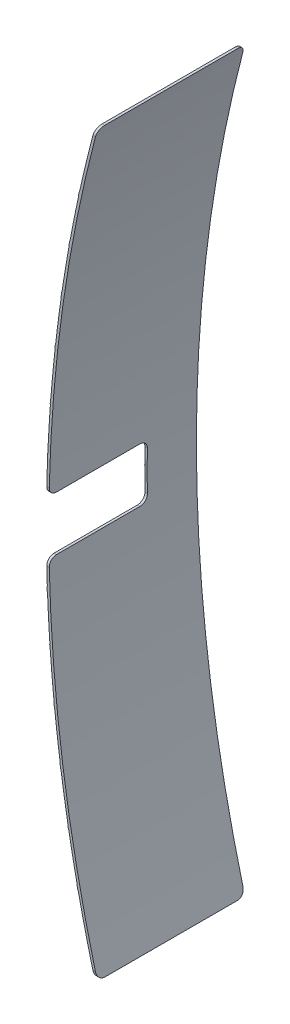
ISO-10303-21;
HEADER;
FILE_DESCRIPTION(('STEP AP214'),'2;1');
FILE_NAME('part.step','',(''),(''),'','','');
FILE_SCHEMA(('AUTOMOTIVE_DESIGN { 1 0 10303 214 1 1 1 1 }'));
ENDSEC;
DATA;
#1=APPLICATION_CONTEXT('core data for automotive mechanical design processes');
#2=APPLICATION_PROTOCOL_DEFINITION('international standard','automotive_design',2000,#1);
#3=PRODUCT_CONTEXT('',#1,'mechanical');
#4=PRODUCT('Part','Part','',(#3));
#5=PRODUCT_RELATED_PRODUCT_CATEGORY('part','',(#4));
#6=PRODUCT_DEFINITION_FORMATION('','',#4);
#7=PRODUCT_DEFINITION_CONTEXT('part definition',#1,'design');
#8=PRODUCT_DEFINITION('design','',#6,#7);
#9=PRODUCT_DEFINITION_SHAPE('','',#8);
#10=(LENGTH_UNIT() NAMED_UNIT(*) SI_UNIT(.MILLI.,.METRE.));
#11=(NAMED_UNIT(*) PLANE_ANGLE_UNIT() SI_UNIT($,.RADIAN.));
#12=(NAMED_UNIT(*) SI_UNIT($,.STERADIAN.) SOLID_ANGLE_UNIT());
#13=UNCERTAINTY_MEASURE_WITH_UNIT(LENGTH_MEASURE(1.E-05),#10,'distance_accuracy_value','');
#14=(GEOMETRIC_REPRESENTATION_CONTEXT(3) GLOBAL_UNCERTAINTY_ASSIGNED_CONTEXT((#13)) GLOBAL_UNIT_ASSIGNED_CONTEXT((#10,
#11,#12)) REPRESENTATION_CONTEXT('',''));
#15=CARTESIAN_POINT('',(0.,0.,0.));
#16=DIRECTION('',(0.,0.,1.));
#17=DIRECTION('',(1.,0.,0.));
#18=AXIS2_PLACEMENT_3D('',#15,#16,#17);
#19=CARTESIAN_POINT('',(0.,0.,6.));
#20=DIRECTION('',(0.,0.,-1.));
#21=DIRECTION('',(-1.,0.,0.));
#22=AXIS2_PLACEMENT_3D('',#19,#20,#21);
#23=CYLINDRICAL_SURFACE('',#22,58.1);
#24=CARTESIAN_POINT('',(0.,0.,6.));
#25=DIRECTION('',(0.,0.,1.));
#26=DIRECTION('',(1.,0.,0.));
#27=AXIS2_PLACEMENT_3D('',#24,#25,#26);
#28=CIRCLE('',#27,58.1);
#29=CARTESIAN_POINT('',(-58.0510340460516,2.38483672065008,6.));
#30=VERTEX_POINT('',#29);
#31=CARTESIAN_POINT('',(-58.0831300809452,1.4,6.));
#32=VERTEX_POINT('',#31);
#33=EDGE_CURVE('E1098',#30,#32,#28,.T.);
#34=ORIENTED_EDGE('',*,*,#33,.F.);
#35=DIRECTION('',(0.,0.,-1.));
#36=VECTOR('',#35,1.);
#37=CARTESIAN_POINT('',(-58.0510340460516,2.38483672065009,6.));
#38=LINE('',#37,#36);
#39=CARTESIAN_POINT('',(-58.0510340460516,2.38483672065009,2.));
#40=VERTEX_POINT('',#39);
#41=EDGE_CURVE('E961',#30,#40,#38,.T.);
#42=ORIENTED_EDGE('',*,*,#41,.T.);
#43=CARTESIAN_POINT('',(0.,0.,2.));
#44=DIRECTION('',(0.,0.,-1.));
#45=DIRECTION('',(-0.999009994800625,0.044486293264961,0.));
#46=AXIS2_PLACEMENT_3D('',#43,#44,#45);
#47=CIRCLE('',#46,58.1);
#48=CARTESIAN_POINT('',(-58.0424806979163,2.58465363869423,2.));
#49=VERTEX_POINT('',#48);
#50=EDGE_CURVE('E945',#40,#49,#47,.T.);
#51=ORIENTED_EDGE('',*,*,#50,.T.);
#52=DIRECTION('',(0.,0.,1.));
#53=VECTOR('',#52,1.);
#54=CARTESIAN_POINT('',(-58.0424806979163,2.58465363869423,2.));
#55=LINE('',#54,#53);
#56=CARTESIAN_POINT('',(-58.0424806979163,2.58465363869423,6.));
#57=VERTEX_POINT('',#56);
#58=EDGE_CURVE('E951',#49,#57,#55,.T.);
#59=ORIENTED_EDGE('',*,*,#58,.T.);
#60=CARTESIAN_POINT('',(-57.934565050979,4.38134366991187,6.));
#61=VERTEX_POINT('',#60);
#62=EDGE_CURVE('E977',#61,#57,#28,.T.);
#63=ORIENTED_EDGE('',*,*,#62,.F.);
#64=DIRECTION('',(0.,0.,-1.));
#65=VECTOR('',#64,1.);
#66=CARTESIAN_POINT('',(-57.934565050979,4.38134366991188,5.99999999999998));
#67=LINE('',#66,#65);
#68=CARTESIAN_POINT('',(-57.934565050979,4.38134366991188,1.99999999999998));
#69=VERTEX_POINT('',#68);
#70=EDGE_CURVE('E957',#61,#69,#67,.T.);
#71=ORIENTED_EDGE('',*,*,#70,.T.);
#72=CARTESIAN_POINT('',(0.,0.,1.99999999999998));
#73=DIRECTION('',(0.,0.,-1.));
#74=DIRECTION('',(-0.996887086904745,0.0788424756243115,0.));
#75=AXIS2_PLACEMENT_3D('',#72,#73,#74);
#76=CIRCLE('',#75,58.1);
#77=CARTESIAN_POINT('',(-57.9191397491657,4.5807478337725,1.99999999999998));
#78=VERTEX_POINT('',#77);
#79=EDGE_CURVE('E1004',#69,#78,#76,.T.);
#80=ORIENTED_EDGE('',*,*,#79,.T.);
#81=DIRECTION('',(0.,0.,1.));
#82=VECTOR('',#81,1.);
#83=CARTESIAN_POINT('',(-57.9191397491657,4.5807478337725,1.99999999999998));
#84=LINE('',#83,#82);
#85=CARTESIAN_POINT('',(-57.9191397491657,4.5807478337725,6.));
#86=VERTEX_POINT('',#85);
#87=EDGE_CURVE('E999',#78,#86,#84,.T.);
#88=ORIENTED_EDGE('',*,*,#87,.T.);
#89=CARTESIAN_POINT('',(-57.7494520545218,6.37265936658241,6.));
#90=VERTEX_POINT('',#89);
#91=EDGE_CURVE('E988',#90,#86,#28,.T.);
#92=ORIENTED_EDGE('',*,*,#91,.F.);
#93=DIRECTION('',(0.,0.,-1.));
#94=VECTOR('',#93,1.);
#95=CARTESIAN_POINT('',(-57.7494520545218,6.37265936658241,5.99999999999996));
#96=LINE('',#95,#94);
#97=CARTESIAN_POINT('',(-57.7494520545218,6.37265936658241,1.99999999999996));
#98=VERTEX_POINT('',#97);
#99=EDGE_CURVE('E1003',#90,#98,#96,.T.);
#100=ORIENTED_EDGE('',*,*,#99,.T.);
#101=CARTESIAN_POINT('',(0.,0.,1.99999999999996));
#102=DIRECTION('',(0.,0.,-1.));
#103=DIRECTION('',(-0.993583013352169,0.113105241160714,0.));
#104=AXIS2_PLACEMENT_3D('',#101,#102,#103);
#105=CIRCLE('',#104,58.1);
#106=CARTESIAN_POINT('',(-57.727173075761,6.57141451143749,1.99999999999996));
#107=VERTEX_POINT('',#106);
#108=EDGE_CURVE('E1041',#98,#107,#105,.T.);
#109=ORIENTED_EDGE('',*,*,#108,.T.);
#110=DIRECTION('',(0.,0.,1.));
#111=VECTOR('',#110,1.);
#112=CARTESIAN_POINT('',(-57.727173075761,6.57141451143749,1.99999999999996));
#113=LINE('',#112,#111);
#114=CARTESIAN_POINT('',(-57.727173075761,6.57141451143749,6.));
#115=VERTEX_POINT('',#114);
#116=EDGE_CURVE('E1037',#107,#115,#113,.T.);
#117=ORIENTED_EDGE('',*,*,#116,.T.);
#118=CARTESIAN_POINT('',(-57.4959143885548,8.35642439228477,6.));
#119=VERTEX_POINT('',#118);
#120=EDGE_CURVE('E1026',#119,#115,#28,.T.);
#121=ORIENTED_EDGE('',*,*,#120,.F.);
#122=DIRECTION('',(0.,0.,-1.));
#123=VECTOR('',#122,1.);
#124=CARTESIAN_POINT('',(-57.4959143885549,8.35642439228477,5.99999999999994));
#125=LINE('',#124,#123);
#126=CARTESIAN_POINT('',(-57.4959143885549,8.35642439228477,1.99999999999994));
#127=VERTEX_POINT('',#126);
#128=EDGE_CURVE('E530',#119,#127,#125,.T.);
#129=ORIENTED_EDGE('',*,*,#128,.T.);
#130=CARTESIAN_POINT('',(0.,0.,1.99999999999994));
#131=DIRECTION('',(0.,0.,-1.));
#132=DIRECTION('',(-0.989101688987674,0.147233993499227,0.));
#133=AXIS2_PLACEMENT_3D('',#130,#131,#132);
#134=CIRCLE('',#133,58.1);
#135=CARTESIAN_POINT('',(-57.4668081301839,8.55429502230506,1.99999999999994));
#136=VERTEX_POINT('',#135);
#137=EDGE_CURVE('E1076',#127,#136,#134,.T.);
#138=ORIENTED_EDGE('',*,*,#137,.T.);
#139=DIRECTION('',(0.,0.,1.));
#140=VECTOR('',#139,1.);
#141=CARTESIAN_POINT('',(-57.4668081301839,8.55429502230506,1.99999999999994));
#142=LINE('',#141,#140);
#143=CARTESIAN_POINT('',(-57.4668081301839,8.55429502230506,6.));
#144=VERTEX_POINT('',#143);
#145=EDGE_CURVE('E1072',#136,#144,#142,.T.);
#146=ORIENTED_EDGE('',*,*,#145,.T.);
#147=CARTESIAN_POINT('',(-57.174252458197,10.3302882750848,6.));
#148=VERTEX_POINT('',#147);
#149=EDGE_CURVE('E1062',#148,#144,#28,.T.);
#150=ORIENTED_EDGE('',*,*,#149,.F.);
#151=DIRECTION('',(0.,0.,-1.));
#152=VECTOR('',#151,1.);
#153=CARTESIAN_POINT('',(-57.174252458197,10.3302882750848,5.99999999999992));
#154=LINE('',#153,#152);
#155=CARTESIAN_POINT('',(-57.174252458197,10.3302882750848,1.99999999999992));
#156=VERTEX_POINT('',#155);
#157=EDGE_CURVE('E1075',#148,#156,#154,.T.);
#158=ORIENTED_EDGE('',*,*,#157,.T.);
#159=CARTESIAN_POINT('',(0.,0.,1.99999999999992));
#160=DIRECTION('',(0.,0.,-1.));
#161=DIRECTION('',(-0.983448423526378,0.181188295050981,0.));
#162=AXIS2_PLACEMENT_3D('',#159,#160,#161);
#163=CIRCLE('',#162,58.1);
#164=CARTESIAN_POINT('',(-57.1383534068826,10.527039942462,1.99999999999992));
#165=VERTEX_POINT('',#164);
#166=EDGE_CURVE('E1655',#156,#165,#163,.T.);
#167=ORIENTED_EDGE('',*,*,#166,.T.);
#168=DIRECTION('',(0.,0.,1.));
#169=VECTOR('',#168,1.);
#170=CARTESIAN_POINT('',(-57.1383534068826,10.527039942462,1.99999999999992));
#171=LINE('',#170,#169);
#172=CARTESIAN_POINT('',(-57.1383534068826,10.527039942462,6.));
#173=VERTEX_POINT('',#172);
#174=EDGE_CURVE('E1232',#165,#173,#171,.T.);
#175=ORIENTED_EDGE('',*,*,#174,.T.);
#176=CARTESIAN_POINT('',(-56.7848473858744,12.2919122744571,6.));
#177=VERTEX_POINT('',#176);
#178=EDGE_CURVE('E1094',#177,#173,#28,.T.);
#179=ORIENTED_EDGE('',*,*,#178,.F.);
#180=DIRECTION('',(0.,0.,-1.));
#181=VECTOR('',#180,1.);
#182=CARTESIAN_POINT('',(-56.7848473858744,12.2919122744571,5.9999999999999));
#183=LINE('',#182,#181);
#184=CARTESIAN_POINT('',(-56.7848473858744,12.2919122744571,1.9999999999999));
#185=VERTEX_POINT('',#184);
#186=EDGE_CURVE('E1229',#177,#185,#183,.T.);
#187=ORIENTED_EDGE('',*,*,#186,.T.);
#188=CARTESIAN_POINT('',(0.,0.,1.9999999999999));
#189=DIRECTION('',(0.,0.,-1.));
#190=DIRECTION('',(-0.9766299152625,0.214927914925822,0.));
#191=AXIS2_PLACEMENT_3D('',#188,#189,#190);
#192=CIRCLE('',#191,58.1);
#193=CARTESIAN_POINT('',(-56.7421980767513,12.4873118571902,1.9999999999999));
#194=VERTEX_POINT('',#193);
#195=EDGE_CURVE('E1225',#185,#194,#192,.T.);
#196=ORIENTED_EDGE('',*,*,#195,.T.);
#197=DIRECTION('',(0.,0.,1.));
#198=VECTOR('',#197,1.);
#199=CARTESIAN_POINT('',(-56.7421980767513,12.4873118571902,1.9999999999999));
#200=LINE('',#199,#198);
#201=CARTESIAN_POINT('',(-56.7421980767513,12.4873118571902,6.));
#202=VERTEX_POINT('',#201);
#203=EDGE_CURVE('E1220',#194,#202,#200,.T.);
#204=ORIENTED_EDGE('',*,*,#203,.T.);
#205=CARTESIAN_POINT('',(-56.2096077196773,14.7,6.));
#206=VERTEX_POINT('',#205);
#207=EDGE_CURVE('E1112',#206,#202,#28,.T.);
#208=ORIENTED_EDGE('',*,*,#207,.F.);
#209=CARTESIAN_POINT('',(-56.2096077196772,14.7,6.));
#210=CARTESIAN_POINT('',(-56.2050797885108,14.7173150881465,6.00001220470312));
#211=CARTESIAN_POINT('',(-56.2005435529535,14.7346267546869,5.99850157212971));
#212=CARTESIAN_POINT('',(-56.1915819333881,14.7687650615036,5.99252307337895));
#213=CARTESIAN_POINT('',(-56.1871565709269,14.7855916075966,5.98805463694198));
#214=CARTESIAN_POINT('',(-56.1785426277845,14.8182872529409,5.97624440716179));
#215=CARTESIAN_POINT('',(-56.1743542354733,14.8341555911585,5.96890036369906));
#216=CARTESIAN_POINT('',(-56.1663479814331,14.864440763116,5.9515227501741));
#217=CARTESIAN_POINT('',(-56.1625299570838,14.8788582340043,5.94149036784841));
#218=CARTESIAN_POINT('',(-56.1554424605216,14.9055852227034,5.91916492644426));
#219=CARTESIAN_POINT('',(-56.1521654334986,14.9179238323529,5.90690913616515));
#220=CARTESIAN_POINT('',(-56.1462006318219,14.9403577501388,5.88036078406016));
#221=CARTESIAN_POINT('',(-56.143512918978,14.9504528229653,5.86606800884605));
#222=CARTESIAN_POINT('',(-56.138901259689,14.9677601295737,5.83634832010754));
#223=CARTESIAN_POINT('',(-56.1369555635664,14.9750545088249,5.8209725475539));
#224=CARTESIAN_POINT('',(-56.1337811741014,14.9869493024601,5.78915055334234));
#225=CARTESIAN_POINT('',(-56.1325516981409,14.9915526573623,5.77270552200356));
#226=CARTESIAN_POINT('',(-56.1312348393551,14.9964822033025,5.74676287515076));
#227=CARTESIAN_POINT('',(-56.1308825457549,14.9978007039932,5.73745608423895));
#228=CARTESIAN_POINT('',(-56.1304126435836,14.9995592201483,5.71876776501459));
#229=CARTESIAN_POINT('',(-56.1302946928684,15.0000005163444,5.70938636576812));
#230=CARTESIAN_POINT('',(-56.1302948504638,15.0000000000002,5.70000000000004));
#231=B_SPLINE_CURVE_WITH_KNOTS('',3,(#209,#210,#211,#212,#213,#214,#215,#216,#217,#218,#219,
#220,#221,#222,#223,#224,#225,#226,#227,#228,#229,#230),.UNSPECIFIED.,.F.,.F.,(4,2,2,2,2,2,2,2,
2,2,4),(0.,0.0536273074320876,0.107264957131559,0.160944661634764,0.214600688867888,
0.26742884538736,0.320262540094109,0.371400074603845,0.422481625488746,0.450661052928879,
0.478799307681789),.UNSPECIFIED.);
#232=CARTESIAN_POINT('',(-56.1302948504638,15.,5.7));
#233=VERTEX_POINT('',#232);
#234=EDGE_CURVE('E1224',#206,#233,#231,.T.);
#235=ORIENTED_EDGE('',*,*,#234,.T.);
#236=DIRECTION('',(0.,0.,-1.));
#237=VECTOR('',#236,1.);
#238=CARTESIAN_POINT('',(-56.1302948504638,15.,6.));
#239=LINE('',#238,#237);
#240=CARTESIAN_POINT('',(-56.1302948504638,15.,0.3));
#241=VERTEX_POINT('',#240);
#242=EDGE_CURVE('E1973',#233,#241,#239,.T.);
#243=ORIENTED_EDGE('',*,*,#242,.T.);
#244=CARTESIAN_POINT('',(-56.1302948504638,15.,0.3));
#245=CARTESIAN_POINT('',(-56.1302903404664,15.0000161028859,0.283533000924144));
#246=CARTESIAN_POINT('',(-56.1306568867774,14.9986452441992,0.267073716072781));
#247=CARTESIAN_POINT('',(-56.132097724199,14.9932524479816,0.234655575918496));
#248=CARTESIAN_POINT('',(-56.1331707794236,14.9892351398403,0.218695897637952));
#249=CARTESIAN_POINT('',(-56.1359906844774,14.9786707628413,0.187699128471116));
#250=CARTESIAN_POINT('',(-56.1377376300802,14.9721233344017,0.172662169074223));
#251=CARTESIAN_POINT('',(-56.1418443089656,14.9567169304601,0.143915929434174));
#252=CARTESIAN_POINT('',(-56.1442041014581,14.9478577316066,0.13020677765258));
#253=CARTESIAN_POINT('',(-56.1494994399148,14.9279543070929,0.104275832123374));
#254=CARTESIAN_POINT('',(-56.1524429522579,14.916879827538,0.0920789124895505));
#255=CARTESIAN_POINT('',(-56.158791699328,14.8929603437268,0.069707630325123));
#256=CARTESIAN_POINT('',(-56.1621970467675,14.8801149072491,0.059533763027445));
#257=CARTESIAN_POINT('',(-56.169485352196,14.8525797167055,0.0411521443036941));
#258=CARTESIAN_POINT('',(-56.1733801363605,14.8378439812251,0.033018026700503));
#259=CARTESIAN_POINT('',(-56.1814429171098,14.8072860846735,0.0193404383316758));
#260=CARTESIAN_POINT('',(-56.1856108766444,14.7914640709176,0.0137966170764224));
#261=CARTESIAN_POINT('',(-56.1930927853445,14.7630107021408,0.00641619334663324));
#262=CARTESIAN_POINT('',(-56.196374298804,14.7505146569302,0.00401167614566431));
#263=CARTESIAN_POINT('',(-56.2029742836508,14.725347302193,0.000803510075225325));
#264=CARTESIAN_POINT('',(-56.2062926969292,14.7126762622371,-2.37308624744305E-06));
#265=CARTESIAN_POINT('',(-56.2096077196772,14.7,0.));
#266=B_SPLINE_CURVE_WITH_KNOTS('',3,(#244,#245,#246,#247,#248,#249,#250,#251,#252,#253,#254,
#255,#256,#257,#258,#259,#260,#261,#262,#263,#264,#265),.UNSPECIFIED.,.F.,.F.,(4,2,2,2,2,2,2,2,
2,2,4),(0.,0.0493282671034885,0.0985704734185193,0.147819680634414,0.19707364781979,
0.247052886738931,0.297044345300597,0.348641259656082,0.400231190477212,0.439560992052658,
0.478835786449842),.UNSPECIFIED.);
#267=CARTESIAN_POINT('',(-56.2096077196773,14.7,0.));
#268=VERTEX_POINT('',#267);
#269=EDGE_CURVE('E1823',#241,#268,#266,.T.);
#270=ORIENTED_EDGE('',*,*,#269,.T.);
#271=CARTESIAN_POINT('',(0.,0.,0.));
#272=DIRECTION('',(0.,0.,1.));
#273=DIRECTION('',(1.,0.,0.));
#274=AXIS2_PLACEMENT_3D('',#271,#272,#273);
#275=CIRCLE('',#274,58.1);
#276=CARTESIAN_POINT('',(-58.0150215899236,3.1412210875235,0.));
#277=VERTEX_POINT('',#276);
#278=EDGE_CURVE('E1569',#268,#277,#275,.T.);
#279=ORIENTED_EDGE('',*,*,#278,.T.);
#280=CARTESIAN_POINT('',(-58.0998246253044,0.142753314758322,2.));
#281=CARTESIAN_POINT('',(-58.0973675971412,1.14275044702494,1.33333323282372));
#282=CARTESIAN_POINT('',(-58.069087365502,2.14268356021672,0.666666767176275));
#283=CARTESIAN_POINT('',(-58.0150215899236,3.1412210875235,0.));
#284=B_SPLINE_CURVE_WITH_KNOTS('',3,(#280,#281,#282,#283),.UNSPECIFIED.,.F.,.F.,(4,4),(0.,1.),.UNSPECIFIED.);
#285=CARTESIAN_POINT('',(-58.0998246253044,0.142753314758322,2.));
#286=VERTEX_POINT('',#285);
#287=EDGE_CURVE('E1578',#277,#286,#284,.F.);
#288=ORIENTED_EDGE('',*,*,#287,.T.);
#289=CARTESIAN_POINT('',(0.,0.,2.));
#290=DIRECTION('',(0.,0.,-1.));
#291=DIRECTION('',(-1.,0.,0.));
#292=AXIS2_PLACEMENT_3D('',#289,#290,#291);
#293=CIRCLE('',#292,58.1);
#294=CARTESIAN_POINT('',(-58.0944919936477,0.8,2.));
#295=VERTEX_POINT('',#294);
#296=EDGE_CURVE('E1587',#286,#295,#293,.T.);
#297=ORIENTED_EDGE('',*,*,#296,.T.);
#298=CARTESIAN_POINT('',(-58.0944919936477,0.8,2.));
#299=CARTESIAN_POINT('',(-58.0942598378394,0.816879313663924,1.99998567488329));
#300=CARTESIAN_POINT('',(-58.094019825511,0.833754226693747,2.00142369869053));
#301=CARTESIAN_POINT('',(-58.0935328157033,0.86701361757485,2.0070986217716));
#302=CARTESIAN_POINT('',(-58.0932858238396,0.883398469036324,2.01133332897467));
#303=CARTESIAN_POINT('',(-58.0927930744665,0.915231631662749,2.02249877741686));
#304=CARTESIAN_POINT('',(-58.0925473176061,0.930679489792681,2.02943081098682));
#305=CARTESIAN_POINT('',(-58.0920670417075,0.960189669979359,2.04578815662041));
#306=CARTESIAN_POINT('',(-58.0918325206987,0.974252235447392,2.05521302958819));
#307=CARTESIAN_POINT('',(-58.0913847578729,1.00059530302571,2.07629009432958));
#308=CARTESIAN_POINT('',(-58.0911715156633,1.01287583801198,2.08794224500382));
#309=CARTESIAN_POINT('',(-58.090776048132,1.03530879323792,2.11314606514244));
#310=CARTESIAN_POINT('',(-58.0905938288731,1.045460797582,2.12669810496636));
#311=CARTESIAN_POINT('',(-58.0902692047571,1.0633456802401,2.15531452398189));
#312=CARTESIAN_POINT('',(-58.0901268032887,1.07107835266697,2.17037903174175));
#313=CARTESIAN_POINT('',(-58.0898889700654,1.08390074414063,2.20158982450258));
#314=CARTESIAN_POINT('',(-58.0897935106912,1.08899201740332,2.2177354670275));
#315=CARTESIAN_POINT('',(-58.0896782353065,1.09512026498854,2.24498345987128));
#316=CARTESIAN_POINT('',(-58.0896437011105,1.09694905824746,2.25591422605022));
#317=CARTESIAN_POINT('',(-58.0895975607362,1.0993887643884,2.27789513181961));
#318=CARTESIAN_POINT('',(-58.0895859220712,1.10000140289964,2.28894507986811));
#319=CARTESIAN_POINT('',(-58.0895859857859,1.1000000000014,2.29999999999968));
#320=B_SPLINE_CURVE_WITH_KNOTS('',3,(#298,#299,#300,#301,#302,#303,#304,#305,#306,#307,#308,
#309,#310,#311,#312,#313,#314,#315,#316,#317,#318,#319),.UNSPECIFIED.,.F.,.F.,(4,2,2,2,2,2,2,2,
2,2,4),(0.,0.0505754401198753,0.101111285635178,0.151671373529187,0.202222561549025,
0.252772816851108,0.303332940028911,0.353897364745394,0.404432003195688,0.437617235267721,
0.470755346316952),.UNSPECIFIED.);
#321=CARTESIAN_POINT('',(-58.0895859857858,1.1,2.3));
#322=VERTEX_POINT('',#321);
#323=EDGE_CURVE('E2590',#295,#322,#320,.T.);
#324=ORIENTED_EDGE('',*,*,#323,.T.);
#325=DIRECTION('',(0.,0.,-1.));
#326=VECTOR('',#325,1.);
#327=CARTESIAN_POINT('',(-58.0895859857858,1.1,6.));
#328=LINE('',#327,#326);
#329=CARTESIAN_POINT('',(-58.0895859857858,1.1,5.7));
#330=VERTEX_POINT('',#329);
#331=EDGE_CURVE('E1131',#322,#330,#328,.F.);
#332=ORIENTED_EDGE('',*,*,#331,.T.);
#333=CARTESIAN_POINT('',(-58.0895859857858,1.1,5.7));
#334=CARTESIAN_POINT('',(-58.089586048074,1.09998565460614,5.71687511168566));
#335=CARTESIAN_POINT('',(-58.0895590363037,1.10142298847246,5.73374592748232));
#336=CARTESIAN_POINT('',(-58.0894513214,1.10709514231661,5.76699732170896));
#337=CARTESIAN_POINT('',(-58.0893706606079,1.11132775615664,5.78337827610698));
#338=CARTESIAN_POINT('',(-58.0891560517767,1.1224875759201,5.81520400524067));
#339=CARTESIAN_POINT('',(-58.0890220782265,1.12941607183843,5.8306483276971));
#340=CARTESIAN_POINT('',(-58.088701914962,1.145764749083,5.86015199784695));
#341=CARTESIAN_POINT('',(-58.0885157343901,1.15518449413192,5.87421158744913));
#342=CARTESIAN_POINT('',(-58.088092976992,1.17625032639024,5.90055056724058));
#343=CARTESIAN_POINT('',(-58.0878563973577,1.1878965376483,5.91282985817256));
#344=CARTESIAN_POINT('',(-58.0873357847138,1.21308689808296,5.93526140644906));
#345=CARTESIAN_POINT('',(-58.0870517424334,1.2266314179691,5.94541324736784));
#346=CARTESIAN_POINT('',(-58.0864406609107,1.25523538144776,5.9633020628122));
#347=CARTESIAN_POINT('',(-58.0861136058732,1.27029538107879,5.97103814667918));
#348=CARTESIAN_POINT('',(-58.0854228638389,1.30149665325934,5.98386826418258));
#349=CARTESIAN_POINT('',(-58.0850591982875,1.31763729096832,5.98896383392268));
#350=CARTESIAN_POINT('',(-58.0844331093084,1.34489691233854,5.99510478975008));
#351=CARTESIAN_POINT('',(-58.0841786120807,1.35584480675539,5.99693939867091));
#352=CARTESIAN_POINT('',(-58.0836605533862,1.37786030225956,5.99938684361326));
#353=CARTESIAN_POINT('',(-58.0833970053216,1.38892771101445,6.00000141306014));
#354=CARTESIAN_POINT('',(-58.0831300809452,1.39999999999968,6.00000000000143));
#355=B_SPLINE_CURVE_WITH_KNOTS('',3,(#333,#334,#335,#336,#337,#338,#339,#340,#341,#342,#343,
#344,#345,#346,#347,#348,#349,#350,#351,#352,#353,#354),.UNSPECIFIED.,.F.,.F.,(4,2,2,2,2,2,2,2,
2,2,4),(0.,0.0505580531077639,0.101076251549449,0.151618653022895,0.202152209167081,
0.252688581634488,0.303234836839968,0.353799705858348,0.404335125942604,0.437582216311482,
0.470782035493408),.UNSPECIFIED.);
#356=EDGE_CURVE('E1123',#330,#32,#355,.T.);
#357=ORIENTED_EDGE('',*,*,#356,.T.);
#358=EDGE_LOOP('',(#34,#42,#51,#59,#63,#71,#80,#88,#92,#100,#109,#117,#121,#129,#138,#146,#150,
#158,#167,#175,#179,#187,#196,#204,#208,#235,#243,#270,#279,#288,#297,#324,#332,#357));
#359=FACE_BOUND('',#358,.T.);
#360=ADVANCED_FACE('F526',(#359),#23,.T.);
#361=CARTESIAN_POINT('',(0.,0.,6.));
#362=DIRECTION('',(0.,0.,1.));
#363=DIRECTION('',(1.,0.,0.));
#364=AXIS2_PLACEMENT_3D('',#361,#362,#363);
#365=PLANE('',#364);
#366=ORIENTED_EDGE('',*,*,#207,.T.);
#367=DIRECTION('',(0.9766299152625,-0.214927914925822,0.));
#368=VECTOR('',#367,1.);
#369=CARTESIAN_POINT('',(-56.7421980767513,12.4873118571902,6.));
#370=LINE('',#369,#368);
#371=CARTESIAN_POINT('',(-56.7519643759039,12.4894611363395,6.));
#372=VERTEX_POINT('',#371);
#373=EDGE_CURVE('E1201',#372,#202,#370,.T.);
#374=ORIENTED_EDGE('',*,*,#373,.F.);
#375=CARTESIAN_POINT('',(0.,0.,6.));
#376=DIRECTION('',(0.,0.,-1.));
#377=DIRECTION('',(-1.,0.,0.));
#378=AXIS2_PLACEMENT_3D('',#375,#376,#377);
#379=CIRCLE('',#378,58.11);
#380=CARTESIAN_POINT('',(-56.7946210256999,12.2940279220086,6.));
#381=VERTEX_POINT('',#380);
#382=EDGE_CURVE('E1122',#372,#381,#379,.F.);
#383=ORIENTED_EDGE('',*,*,#382,.T.);
#384=DIRECTION('',(0.977363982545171,-0.211564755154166,0.));
#385=VECTOR('',#384,1.);
#386=CARTESIAN_POINT('',(-56.7848473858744,12.2919122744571,6.));
#387=LINE('',#386,#385);
#388=EDGE_CURVE('E1129',#381,#177,#387,.T.);
#389=ORIENTED_EDGE('',*,*,#388,.T.);
#390=ORIENTED_EDGE('',*,*,#178,.T.);
#391=DIRECTION('',(0.983448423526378,-0.181188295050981,0.));
#392=VECTOR('',#391,1.);
#393=CARTESIAN_POINT('',(-57.1383534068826,10.527039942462,6.));
#394=LINE('',#393,#392);
#395=CARTESIAN_POINT('',(-57.1481878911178,10.5288518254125,6.));
#396=VERTEX_POINT('',#395);
#397=EDGE_CURVE('E1065',#396,#173,#394,.T.);
#398=ORIENTED_EDGE('',*,*,#397,.F.);
#399=CARTESIAN_POINT('',(0.,0.,6.));
#400=DIRECTION('',(0.,0.,-1.));
#401=DIRECTION('',(-1.,0.,0.));
#402=AXIS2_PLACEMENT_3D('',#399,#400,#401);
#403=CIRCLE('',#402,58.11);
#404=CARTESIAN_POINT('',(-57.1840931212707,10.3320662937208,6.));
#405=VERTEX_POINT('',#404);
#406=EDGE_CURVE('E1192',#396,#405,#403,.F.);
#407=ORIENTED_EDGE('',*,*,#406,.T.);
#408=DIRECTION('',(0.98406630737,-0.177801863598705,0.));
#409=VECTOR('',#408,1.);
#410=CARTESIAN_POINT('',(-57.174252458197,10.3302882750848,6.));
#411=LINE('',#410,#409);
#412=EDGE_CURVE('E1093',#405,#148,#411,.T.);
#413=ORIENTED_EDGE('',*,*,#412,.T.);
#414=ORIENTED_EDGE('',*,*,#149,.T.);
#415=DIRECTION('',(0.989101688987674,-0.147233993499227,0.));
#416=VECTOR('',#415,1.);
#417=CARTESIAN_POINT('',(-57.4668081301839,8.55429502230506,6.));
#418=LINE('',#417,#416);
#419=CARTESIAN_POINT('',(-57.4766991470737,8.55576736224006,6.));
#420=VERTEX_POINT('',#419);
#421=EDGE_CURVE('E1030',#420,#144,#418,.T.);
#422=ORIENTED_EDGE('',*,*,#421,.F.);
#423=CARTESIAN_POINT('',(0.,0.,6.));
#424=DIRECTION('',(0.,0.,-1.));
#425=DIRECTION('',(-1.,0.,0.));
#426=AXIS2_PLACEMENT_3D('',#423,#424,#425);
#427=CIRCLE('',#426,58.11);
#428=CARTESIAN_POINT('',(-57.5058104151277,8.3578626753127,6.));
#429=VERTEX_POINT('',#428);
#430=EDGE_CURVE('E1053',#420,#429,#427,.F.);
#431=ORIENTED_EDGE('',*,*,#430,.T.);
#432=DIRECTION('',(0.989602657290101,-0.143828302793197,0.));
#433=VECTOR('',#432,1.);
#434=CARTESIAN_POINT('',(-57.4959143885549,8.35642439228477,6.));
#435=LINE('',#434,#433);
#436=EDGE_CURVE('E1051',#429,#119,#435,.T.);
#437=ORIENTED_EDGE('',*,*,#436,.T.);
#438=ORIENTED_EDGE('',*,*,#120,.T.);
#439=DIRECTION('',(0.993583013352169,-0.113105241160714,0.));
#440=VECTOR('',#439,1.);
#441=CARTESIAN_POINT('',(-57.727173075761,6.57141451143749,6.));
#442=LINE('',#441,#440);
#443=CARTESIAN_POINT('',(-57.7371089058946,6.5725455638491,6.));
#444=VERTEX_POINT('',#443);
#445=EDGE_CURVE('E992',#444,#115,#442,.T.);
#446=ORIENTED_EDGE('',*,*,#445,.F.);
#447=CARTESIAN_POINT('',(0.,0.,6.));
#448=DIRECTION('',(0.,0.,-1.));
#449=DIRECTION('',(-1.,0.,0.));
#450=AXIS2_PLACEMENT_3D('',#447,#448,#449);
#451=CIRCLE('',#450,58.11);
#452=CARTESIAN_POINT('',(-57.7593917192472,6.37375620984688,6.));
#453=VERTEX_POINT('',#452);
#454=EDGE_CURVE('E1016',#444,#453,#451,.F.);
#455=ORIENTED_EDGE('',*,*,#454,.T.);
#456=DIRECTION('',(0.993966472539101,-0.109684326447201,0.));
#457=VECTOR('',#456,1.);
#458=CARTESIAN_POINT('',(-57.7494520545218,6.37265936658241,6.));
#459=LINE('',#458,#457);
#460=EDGE_CURVE('E1013',#453,#90,#459,.T.);
#461=ORIENTED_EDGE('',*,*,#460,.T.);
#462=ORIENTED_EDGE('',*,*,#91,.T.);
#463=DIRECTION('',(0.996887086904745,-0.0788424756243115,0.));
#464=VECTOR('',#463,1.);
#465=CARTESIAN_POINT('',(-57.9191397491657,4.5807478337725,6.));
#466=LINE('',#465,#464);
#467=CARTESIAN_POINT('',(-57.9291086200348,4.58153625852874,6.));
#468=VERTEX_POINT('',#467);
#469=EDGE_CURVE('E970',#468,#86,#466,.T.);
#470=ORIENTED_EDGE('',*,*,#469,.F.);
#471=CARTESIAN_POINT('',(0.,0.,6.));
#472=DIRECTION('',(0.,0.,-1.));
#473=DIRECTION('',(-1.,0.,0.));
#474=AXIS2_PLACEMENT_3D('',#471,#472,#473);
#475=CIRCLE('',#474,58.11);
#476=CARTESIAN_POINT('',(-57.9445365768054,4.38209777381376,6.));
#477=VERTEX_POINT('',#476);
#478=EDGE_CURVE('E978',#468,#477,#475,.F.);
#479=ORIENTED_EDGE('',*,*,#478,.T.);
#480=DIRECTION('',(0.99715258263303,-0.075410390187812,0.));
#481=VECTOR('',#480,1.);
#482=CARTESIAN_POINT('',(-57.934565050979,4.38134366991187,6.));
#483=LINE('',#482,#481);
#484=EDGE_CURVE('E974',#477,#61,#483,.T.);
#485=ORIENTED_EDGE('',*,*,#484,.T.);
#486=ORIENTED_EDGE('',*,*,#62,.T.);
#487=DIRECTION('',(0.999009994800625,-0.0444862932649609,0.));
#488=VECTOR('',#487,1.);
#489=CARTESIAN_POINT('',(-58.0424806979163,2.58465363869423,6.));
#490=LINE('',#489,#488);
#491=CARTESIAN_POINT('',(-58.0524707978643,2.58509850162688,6.));
#492=VERTEX_POINT('',#491);
#493=EDGE_CURVE('E13',#492,#57,#490,.T.);
#494=ORIENTED_EDGE('',*,*,#493,.F.);
#495=CARTESIAN_POINT('',(0.,0.,6.));
#496=DIRECTION('',(0.,0.,-1.));
#497=DIRECTION('',(-1.,0.,0.));
#498=AXIS2_PLACEMENT_3D('',#495,#496,#497);
#499=CIRCLE('',#498,58.11);
#500=CARTESIAN_POINT('',(-58.0610256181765,2.38524719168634,6.));
#501=VERTEX_POINT('',#500);
#502=EDGE_CURVE('E1097',#492,#501,#499,.F.);
#503=ORIENTED_EDGE('',*,*,#502,.T.);
#504=DIRECTION('',(0.999157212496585,-0.0410471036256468,0.));
#505=VECTOR('',#504,1.);
#506=CARTESIAN_POINT('',(-58.0510340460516,2.38483672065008,6.));
#507=LINE('',#506,#505);
#508=EDGE_CURVE('E1101',#501,#30,#507,.T.);
#509=ORIENTED_EDGE('',*,*,#508,.T.);
#510=ORIENTED_EDGE('',*,*,#33,.T.);
#511=DIRECTION('',(-1.,0.,0.));
#512=VECTOR('',#511,1.);
#513=CARTESIAN_POINT('',(-57.9895680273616,1.4,6.));
#514=LINE('',#513,#512);
#515=CARTESIAN_POINT('',(-57.9831009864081,1.4,6.));
#516=VERTEX_POINT('',#515);
#517=EDGE_CURVE('E1103',#32,#516,#514,.F.);
#518=ORIENTED_EDGE('',*,*,#517,.T.);
#519=CARTESIAN_POINT('',(0.,0.,6.));
#520=DIRECTION('',(0.,0.,-1.));
#521=DIRECTION('',(1.,0.,0.));
#522=AXIS2_PLACEMENT_3D('',#519,#520,#521);
#523=CIRCLE('',#522,58.);
#524=CARTESIAN_POINT('',(-56.1062385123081,14.7,6.));
#525=VERTEX_POINT('',#524);
#526=EDGE_CURVE('E1106',#516,#525,#523,.T.);
#527=ORIENTED_EDGE('',*,*,#526,.T.);
#528=DIRECTION('',(-1.,0.,0.));
#529=VECTOR('',#528,1.);
#530=CARTESIAN_POINT('',(-56.1302948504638,14.7,6.));
#531=LINE('',#530,#529);
#532=EDGE_CURVE('E1454',#525,#206,#531,.T.);
#533=ORIENTED_EDGE('',*,*,#532,.T.);
#534=EDGE_LOOP('',(#366,#374,#383,#389,#390,#398,#407,#413,#414,#422,#431,#437,#438,#446,#455,
#461,#462,#470,#479,#485,#486,#494,#503,#509,#510,#518,#527,#533));
#535=FACE_BOUND('',#534,.T.);
#536=ADVANCED_FACE('F1432',(#535),#365,.T.);
#537=CARTESIAN_POINT('',(0.,0.,6.));
#538=DIRECTION('',(0.,0.,-1.));
#539=DIRECTION('',(-1.,0.,0.));
#540=AXIS2_PLACEMENT_3D('',#537,#538,#539);
#541=CYLINDRICAL_SURFACE('',#540,58.);
#542=ORIENTED_EDGE('',*,*,#526,.F.);
#543=CARTESIAN_POINT('',(-57.9831009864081,1.4,6.));
#544=CARTESIAN_POINT('',(-57.9835088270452,1.38312044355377,6.00001432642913));
#545=CARTESIAN_POINT('',(-57.9839086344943,1.366244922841,5.99857625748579));
#546=CARTESIAN_POINT('',(-57.9846826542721,1.33298358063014,5.99290079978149));
#547=CARTESIAN_POINT('',(-57.9850568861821,1.31659739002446,5.9886655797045));
#548=CARTESIAN_POINT('',(-57.9857710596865,1.2847610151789,5.97749828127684));
#549=CARTESIAN_POINT('',(-57.986110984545,1.26931128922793,5.9705648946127));
#550=CARTESIAN_POINT('',(-57.9867495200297,1.23979739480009,5.95420385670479));
#551=CARTESIAN_POINT('',(-57.9870481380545,1.22573297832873,5.94477665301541));
#552=CARTESIAN_POINT('',(-57.9875990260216,1.19938870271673,5.92369559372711));
#553=CARTESIAN_POINT('',(-57.9878513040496,1.187108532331,5.91204212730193));
#554=CARTESIAN_POINT('',(-57.9883061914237,1.16467644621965,5.88683541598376));
#555=CARTESIAN_POINT('',(-57.9885087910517,1.15452494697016,5.873281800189));
#556=CARTESIAN_POINT('',(-57.9888620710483,1.13664242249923,5.84466372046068));
#557=CARTESIAN_POINT('',(-57.9890127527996,1.12891133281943,5.82959929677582));
#558=CARTESIAN_POINT('',(-57.9892609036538,1.11609193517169,5.79838892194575));
#559=CARTESIAN_POINT('',(-57.9893584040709,1.11100207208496,5.78224361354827));
#560=CARTESIAN_POINT('',(-57.9894753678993,1.10487665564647,5.75499931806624));
#561=CARTESIAN_POINT('',(-57.9895101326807,1.10304901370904,5.74407191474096));
#562=CARTESIAN_POINT('',(-57.9895564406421,1.10061084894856,5.72209786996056));
#563=CARTESIAN_POINT('',(-57.9895680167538,1.09999860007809,5.71105142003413));
#564=CARTESIAN_POINT('',(-57.9895680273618,1.09999999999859,5.70000000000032));
#565=B_SPLINE_CURVE_WITH_KNOTS('',3,(#543,#544,#545,#546,#547,#548,#549,#550,#551,#552,#553,
#554,#555,#556,#557,#558,#559,#560,#561,#562,#563,#564),.UNSPECIFIED.,.F.,.F.,(4,2,2,2,2,2,2,2,
2,2,4),(0.,0.0505862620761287,0.101133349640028,0.151704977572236,0.202267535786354,
0.25282126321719,0.303384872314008,0.353947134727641,0.404479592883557,0.437654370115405,
0.470782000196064),.UNSPECIFIED.);
#566=CARTESIAN_POINT('',(-57.9895680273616,1.1,5.7));
#567=VERTEX_POINT('',#566);
#568=EDGE_CURVE('E1443',#516,#567,#565,.T.);
#569=ORIENTED_EDGE('',*,*,#568,.T.);
#570=DIRECTION('',(0.,0.,-1.));
#571=VECTOR('',#570,1.);
#572=CARTESIAN_POINT('',(-57.9895680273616,1.1,6.));
#573=LINE('',#572,#571);
#574=CARTESIAN_POINT('',(-57.9895680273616,1.1,2.3));
#575=VERTEX_POINT('',#574);
#576=EDGE_CURVE('E1480',#567,#575,#573,.T.);
#577=ORIENTED_EDGE('',*,*,#576,.T.);
#578=CARTESIAN_POINT('',(-57.9895680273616,1.1,2.3));
#579=CARTESIAN_POINT('',(-57.9895675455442,1.10001434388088,2.28312453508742));
#580=CARTESIAN_POINT('',(-57.9895950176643,1.09857695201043,2.26625337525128));
#581=CARTESIAN_POINT('',(-57.9897023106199,1.09290457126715,2.23300134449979));
#582=CARTESIAN_POINT('',(-57.9897820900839,1.0886717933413,2.21662009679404));
#583=CARTESIAN_POINT('',(-57.9899904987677,1.07751154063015,2.18479381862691));
#584=CARTESIAN_POINT('',(-57.9901191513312,1.07058277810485,2.16934923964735));
#585=CARTESIAN_POINT('',(-57.9904186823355,1.05423340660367,2.13984503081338));
#586=CARTESIAN_POINT('',(-57.9905895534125,1.04481323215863,2.12578516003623));
#587=CARTESIAN_POINT('',(-57.9909652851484,1.02374598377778,2.09944522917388));
#588=CARTESIAN_POINT('',(-57.9911701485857,1.01209872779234,2.08716531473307));
#589=CARTESIAN_POINT('',(-57.9916043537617,0.986905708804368,2.06473262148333));
#590=CARTESIAN_POINT('',(-57.9918337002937,0.973359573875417,2.05458026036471));
#591=CARTESIAN_POINT('',(-57.992306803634,0.944751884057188,2.03669083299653));
#592=CARTESIAN_POINT('',(-57.9925505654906,0.929689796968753,2.02895461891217));
#593=CARTESIAN_POINT('',(-57.9930424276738,0.898483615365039,2.01612476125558));
#594=CARTESIAN_POINT('',(-57.9932905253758,0.882340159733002,2.01102957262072));
#595=CARTESIAN_POINT('',(-57.9936975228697,0.855081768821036,2.00489140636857));
#596=CARTESIAN_POINT('',(-57.9938578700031,0.844138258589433,2.0030582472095));
#597=CARTESIAN_POINT('',(-57.9941740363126,0.822131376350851,2.00061270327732));
#598=CARTESIAN_POINT('',(-57.9943298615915,0.811068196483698,1.99999858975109));
#599=CARTESIAN_POINT('',(-57.9944824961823,0.800000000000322,1.99999999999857));
#600=B_SPLINE_CURVE_WITH_KNOTS('',3,(#578,#579,#580,#581,#582,#583,#584,#585,#586,#587,#588,
#589,#590,#591,#592,#593,#594,#595,#596,#597,#598,#599),.UNSPECIFIED.,.F.,.F.,(4,2,2,2,2,2,2,2,
2,2,4),(0.,0.050559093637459,0.101078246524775,0.151621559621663,0.202156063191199,
0.252694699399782,0.303243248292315,0.353809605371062,0.404346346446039,0.43757454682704,
0.470755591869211),.UNSPECIFIED.);
#601=CARTESIAN_POINT('',(-57.9944824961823,0.8,2.));
#602=VERTEX_POINT('',#601);
#603=EDGE_CURVE('E2593',#575,#602,#600,.T.);
#604=ORIENTED_EDGE('',*,*,#603,.T.);
#605=CARTESIAN_POINT('',(0.,0.,2.));
#606=DIRECTION('',(0.,0.,-1.));
#607=DIRECTION('',(-1.,0.,0.));
#608=AXIS2_PLACEMENT_3D('',#605,#606,#607);
#609=CIRCLE('',#608,58.);
#610=CARTESIAN_POINT('',(-57.9944824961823,-0.8,2.));
#611=VERTEX_POINT('',#610);
#612=EDGE_CURVE('E1541',#602,#611,#609,.F.);
#613=ORIENTED_EDGE('',*,*,#612,.T.);
#614=CARTESIAN_POINT('',(-57.9944824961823,-0.8,2.));
#615=CARTESIAN_POINT('',(-57.9942499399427,-0.816879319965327,1.99998567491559));
#616=CARTESIAN_POINT('',(-57.9940095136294,-0.833754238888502,2.00142369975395));
#617=CARTESIAN_POINT('',(-57.9935216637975,-0.867013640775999,2.00709862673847));
#618=CARTESIAN_POINT('',(-57.9932742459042,-0.883398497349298,2.01133333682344));
#619=CARTESIAN_POINT('',(-57.9927806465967,-0.915231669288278,2.02249879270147));
#620=CARTESIAN_POINT('',(-57.9925344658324,-0.930679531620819,2.02943083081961));
#621=CARTESIAN_POINT('',(-57.9920533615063,-0.960189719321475,2.04578818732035));
#622=CARTESIAN_POINT('',(-57.9918184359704,-0.97425228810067,2.05521306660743));
#623=CARTESIAN_POINT('',(-57.9913699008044,-1.00059536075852,2.07629014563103));
#624=CARTESIAN_POINT('',(-57.9911562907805,-1.01287589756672,2.08794230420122));
#625=CARTESIAN_POINT('',(-57.9907601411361,-1.03530885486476,2.11314614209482));
#626=CARTESIAN_POINT('',(-57.990577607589,-1.04546085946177,2.12669819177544));
#627=CARTESIAN_POINT('',(-57.9902524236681,-1.06334573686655,2.15531462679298));
#628=CARTESIAN_POINT('',(-57.9901097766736,-1.07107840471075,2.17037914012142));
#629=CARTESIAN_POINT('',(-57.9898715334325,-1.08390078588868,2.2015899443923));
#630=CARTESIAN_POINT('',(-57.9897759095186,-1.08899205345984,2.21773559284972));
#631=CARTESIAN_POINT('',(-57.9896604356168,-1.09512028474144,2.24498357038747));
#632=CARTESIAN_POINT('',(-57.9896258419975,-1.09694907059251,2.25591431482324));
#633=CARTESIAN_POINT('',(-57.9895796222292,-1.09938876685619,2.27789517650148));
#634=CARTESIAN_POINT('',(-57.9895679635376,-1.10000140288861,2.2889451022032));
#635=CARTESIAN_POINT('',(-57.9895680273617,-1.1000000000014,2.29999999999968));
#636=B_SPLINE_CURVE_WITH_KNOTS('',3,(#614,#615,#616,#617,#618,#619,#620,#621,#622,#623,#624,
#625,#626,#627,#628,#629,#630,#631,#632,#633,#634,#635),.UNSPECIFIED.,.F.,.F.,(4,2,2,2,2,2,2,2,
2,2,4),(0.,0.0505754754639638,0.101111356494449,0.151671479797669,0.20222270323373,
0.252772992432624,0.303333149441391,0.353897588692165,0.404432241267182,0.437617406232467,
0.470755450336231),.UNSPECIFIED.);
#637=CARTESIAN_POINT('',(-57.9895680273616,-1.1,2.3));
#638=VERTEX_POINT('',#637);
#639=EDGE_CURVE('E1533',#611,#638,#636,.T.);
#640=ORIENTED_EDGE('',*,*,#639,.T.);
#641=DIRECTION('',(0.,0.,-1.));
#642=VECTOR('',#641,1.);
#643=CARTESIAN_POINT('',(-57.9895680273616,-1.1,6.));
#644=LINE('',#643,#642);
#645=CARTESIAN_POINT('',(-57.9895680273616,-1.1,5.7));
#646=VERTEX_POINT('',#645);
#647=EDGE_CURVE('E1540',#638,#646,#644,.F.);
#648=ORIENTED_EDGE('',*,*,#647,.T.);
#649=CARTESIAN_POINT('',(-57.9895680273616,-1.1,5.7));
#650=CARTESIAN_POINT('',(-57.9895680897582,-1.09998565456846,5.71687510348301));
#651=CARTESIAN_POINT('',(-57.9895410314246,-1.10142298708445,5.73374591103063));
#652=CARTESIAN_POINT('',(-57.9894331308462,-1.10709513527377,5.76699728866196));
#653=CARTESIAN_POINT('',(-57.9893523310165,-1.11132774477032,5.78337823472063));
#654=CARTESIAN_POINT('',(-57.9891373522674,-1.12248755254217,5.81520394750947));
#655=CARTESIAN_POINT('',(-57.9890031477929,-1.12941604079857,5.83064826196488));
#656=CARTESIAN_POINT('',(-57.9886824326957,-1.14576469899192,5.86015191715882));
#657=CARTESIAN_POINT('',(-57.9884959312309,-1.15518443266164,5.87421149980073));
#658=CARTESIAN_POINT('',(-57.9880724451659,-1.17625024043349,5.9005504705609));
#659=CARTESIAN_POINT('',(-57.9878354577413,-1.187896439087,5.91282975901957));
#660=CARTESIAN_POINT('',(-57.9873139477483,-1.21308677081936,5.93526130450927));
#661=CARTESIAN_POINT('',(-57.9870294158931,-1.22663127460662,5.94541314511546));
#662=CARTESIAN_POINT('',(-57.9864172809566,-1.25523521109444,5.96330196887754));
#663=CARTESIAN_POINT('',(-57.9860896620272,-1.27029520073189,5.97103805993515));
#664=CARTESIAN_POINT('',(-57.9853977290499,-1.30149645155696,5.98386819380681));
#665=CARTESIAN_POINT('',(-57.9850334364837,-1.31763707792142,5.98896377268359));
#666=CARTESIAN_POINT('',(-57.9844062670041,-1.34489672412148,5.99510475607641));
#667=CARTESIAN_POINT('',(-57.9841513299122,-1.35584465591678,5.99693937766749));
#668=CARTESIAN_POINT('',(-57.9836323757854,-1.37786022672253,5.99938683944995));
#669=CARTESIAN_POINT('',(-57.983368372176,-1.38892767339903,6.0000014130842));
#670=CARTESIAN_POINT('',(-57.9831009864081,-1.39999999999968,6.00000000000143));
#671=B_SPLINE_CURVE_WITH_KNOTS('',3,(#649,#650,#651,#652,#653,#654,#655,#656,#657,#658,#659,
#660,#661,#662,#663,#664,#665,#666,#667,#668,#669,#670),.UNSPECIFIED.,.F.,.F.,(4,2,2,2,2,2,2,2,
2,2,4),(0.,0.0505580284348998,0.101076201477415,0.151618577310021,0.202152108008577,
0.252688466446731,0.303234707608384,0.353799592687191,0.404335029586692,0.437582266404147,
0.470782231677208),.UNSPECIFIED.);
#672=CARTESIAN_POINT('',(-57.9831009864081,-1.4,6.));
#673=VERTEX_POINT('',#672);
#674=EDGE_CURVE('E1481',#646,#673,#671,.T.);
#675=ORIENTED_EDGE('',*,*,#674,.T.);
#676=CARTESIAN_POINT('',(-56.1062385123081,-14.7,6.));
#677=VERTEX_POINT('',#676);
#678=EDGE_CURVE('E1119',#677,#673,#523,.T.);
#679=ORIENTED_EDGE('',*,*,#678,.F.);
#680=CARTESIAN_POINT('',(-56.1062385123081,-14.7,6.));
#681=CARTESIAN_POINT('',(-56.1017018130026,-14.7173167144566,6.00001219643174));
#682=CARTESIAN_POINT('',(-56.0971567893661,-14.7346300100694,5.99850128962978));
#683=CARTESIAN_POINT('',(-56.0881777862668,-14.7687715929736,5.99252164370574));
#684=CARTESIAN_POINT('',(-56.0837438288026,-14.7855997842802,5.98805232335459));
#685=CARTESIAN_POINT('',(-56.0751131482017,-14.8182986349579,5.97623965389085));
#686=CARTESIAN_POINT('',(-56.0709166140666,-14.8341685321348,5.96889405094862));
#687=CARTESIAN_POINT('',(-56.0628948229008,-14.8644565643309,5.95151257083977));
#688=CARTESIAN_POINT('',(-56.0590694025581,-14.8788753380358,5.94147788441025));
#689=CARTESIAN_POINT('',(-56.0519684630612,-14.9056036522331,5.91914775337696));
#690=CARTESIAN_POINT('',(-56.0486853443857,-14.9179424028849,5.90688973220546));
#691=CARTESIAN_POINT('',(-56.0427095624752,-14.9403761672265,5.88033641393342));
#692=CARTESIAN_POINT('',(-56.0400169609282,-14.9504709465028,5.86604090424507));
#693=CARTESIAN_POINT('',(-56.0353973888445,-14.9677759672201,5.83631722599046));
#694=CARTESIAN_POINT('',(-56.0334485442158,-14.9750686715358,5.82094039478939));
#695=CARTESIAN_POINT('',(-56.030269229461,-14.9869599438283,5.78911635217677));
#696=CARTESIAN_POINT('',(-56.0290379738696,-14.9915614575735,5.77267033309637));
#697=CARTESIAN_POINT('',(-56.0277198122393,-14.9964867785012,5.74673262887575));
#698=CARTESIAN_POINT('',(-56.0273673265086,-14.9978035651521,5.73743180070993));
#699=CARTESIAN_POINT('',(-56.0268971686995,-14.9995597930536,5.71875555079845));
#700=CARTESIAN_POINT('',(-56.0267791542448,-15.0000005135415,5.70938025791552));
#701=CARTESIAN_POINT('',(-56.0267793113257,-15.0000000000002,5.70000000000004));
#702=B_SPLINE_CURVE_WITH_KNOTS('',3,(#680,#681,#682,#683,#684,#685,#686,#687,#688,#689,#690,
#691,#692,#693,#694,#695,#696,#697,#698,#699,#700,#701),.UNSPECIFIED.,.F.,.F.,(4,2,2,2,2,2,2,2,
2,2,4),(0.,0.0536386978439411,0.107287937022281,0.160979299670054,0.214646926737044,
0.267483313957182,0.320325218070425,0.371464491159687,0.422547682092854,0.450708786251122,
0.478828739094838),.UNSPECIFIED.);
#703=CARTESIAN_POINT('',(-56.0267793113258,-15.,5.7));
#704=VERTEX_POINT('',#703);
#705=EDGE_CURVE('E1525',#677,#704,#702,.T.);
#706=ORIENTED_EDGE('',*,*,#705,.T.);
#707=DIRECTION('',(0.,0.,-1.));
#708=VECTOR('',#707,1.);
#709=CARTESIAN_POINT('',(-56.0267793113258,-15.,6.));
#710=LINE('',#709,#708);
#711=CARTESIAN_POINT('',(-56.0267793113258,-15.,0.3));
#712=VERTEX_POINT('',#711);
#713=EDGE_CURVE('E1727',#704,#712,#710,.T.);
#714=ORIENTED_EDGE('',*,*,#713,.T.);
#715=CARTESIAN_POINT('',(-56.0267793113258,-15.,0.3));
#716=CARTESIAN_POINT('',(-56.0267747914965,-15.0000161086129,0.283534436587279));
#717=CARTESIAN_POINT('',(-56.0271419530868,-14.9986454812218,0.26707659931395));
#718=CARTESIAN_POINT('',(-56.0285851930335,-14.9932536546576,0.234661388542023));
#719=CARTESIAN_POINT('',(-56.0296600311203,-14.9892370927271,0.218703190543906));
#720=CARTESIAN_POINT('',(-56.0324845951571,-14.9786747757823,0.187709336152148));
#721=CARTESIAN_POINT('',(-56.0342344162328,-14.972128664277,0.172673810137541));
#722=CARTESIAN_POINT('',(-56.0383478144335,-14.9567255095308,0.143930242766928));
#723=CARTESIAN_POINT('',(-56.0407114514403,-14.947868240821,0.130222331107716));
#724=CARTESIAN_POINT('',(-56.0460154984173,-14.9279688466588,0.104292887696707));
#725=CARTESIAN_POINT('',(-56.0489639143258,-14.916896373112,0.0920963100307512));
#726=CARTESIAN_POINT('',(-56.0553232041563,-14.8929813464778,0.0697253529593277));
#727=CARTESIAN_POINT('',(-56.0587341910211,-14.8801383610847,0.0595514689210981));
#728=CARTESIAN_POINT('',(-56.0660349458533,-14.8526069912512,0.0411682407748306));
#729=CARTESIAN_POINT('',(-56.0699366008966,-14.8378724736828,0.0330327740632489));
#730=CARTESIAN_POINT('',(-56.0780136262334,-14.8073170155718,0.0193522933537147));
#731=CARTESIAN_POINT('',(-56.0821889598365,-14.7914962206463,0.0138069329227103));
#732=CARTESIAN_POINT('',(-56.0896857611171,-14.763038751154,0.00642196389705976));
#733=CARTESIAN_POINT('',(-56.0929747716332,-14.7505372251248,0.00401528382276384));
#734=CARTESIAN_POINT('',(-56.099589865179,-14.7253586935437,0.000804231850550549));
#735=CARTESIAN_POINT('',(-56.1029158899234,-14.7126819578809,-2.37639895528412E-06));
#736=CARTESIAN_POINT('',(-56.1062385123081,-14.7,0.));
#737=B_SPLINE_CURVE_WITH_KNOTS('',3,(#715,#716,#717,#718,#719,#720,#721,#722,#723,#724,#725,
#726,#727,#728,#729,#730,#731,#732,#733,#734,#735,#736),.UNSPECIFIED.,.F.,.F.,(4,2,2,2,2,2,2,2,
2,2,4),(0.,0.0493239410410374,0.0985616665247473,0.147806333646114,0.197055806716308,
0.247032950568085,0.297022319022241,0.348622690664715,0.400216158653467,0.439568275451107,
0.478865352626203),.UNSPECIFIED.);
#738=CARTESIAN_POINT('',(-56.1062385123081,-14.7,0.));
#739=VERTEX_POINT('',#738);
#740=EDGE_CURVE('E1518',#712,#739,#737,.T.);
#741=ORIENTED_EDGE('',*,*,#740,.T.);
#742=CARTESIAN_POINT('',(0.,0.,0.));
#743=DIRECTION('',(0.,0.,-1.));
#744=DIRECTION('',(1.,0.,0.));
#745=AXIS2_PLACEMENT_3D('',#742,#743,#744);
#746=CIRCLE('',#745,58.);
#747=CARTESIAN_POINT('',(-56.1062385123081,14.7,0.));
#748=VERTEX_POINT('',#747);
#749=EDGE_CURVE('E1828',#739,#748,#746,.T.);
#750=ORIENTED_EDGE('',*,*,#749,.T.);
#751=CARTESIAN_POINT('',(-56.1062385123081,14.7,0.));
#752=CARTESIAN_POINT('',(-56.1017018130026,14.7173167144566,-1.21964317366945E-05));
#753=CARTESIAN_POINT('',(-56.0971567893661,14.7346300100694,0.00149871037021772));
#754=CARTESIAN_POINT('',(-56.0881777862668,14.7687715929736,0.00747835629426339));
#755=CARTESIAN_POINT('',(-56.0837438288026,14.7855997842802,0.0119476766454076));
#756=CARTESIAN_POINT('',(-56.0751131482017,14.8182986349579,0.0237603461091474));
#757=CARTESIAN_POINT('',(-56.0709166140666,14.8341685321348,0.0311059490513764));
#758=CARTESIAN_POINT('',(-56.0628948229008,14.8644565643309,0.0484874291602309));
#759=CARTESIAN_POINT('',(-56.0590694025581,14.8788753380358,0.0585221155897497));
#760=CARTESIAN_POINT('',(-56.0519684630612,14.9056036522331,0.0808522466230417));
#761=CARTESIAN_POINT('',(-56.0486853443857,14.9179424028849,0.0931102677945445));
#762=CARTESIAN_POINT('',(-56.0427095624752,14.9403761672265,0.119663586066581));
#763=CARTESIAN_POINT('',(-56.0400169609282,14.9504709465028,0.133959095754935));
#764=CARTESIAN_POINT('',(-56.0353973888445,14.9677759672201,0.163682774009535));
#765=CARTESIAN_POINT('',(-56.0334485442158,14.9750686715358,0.17905960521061));
#766=CARTESIAN_POINT('',(-56.030269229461,14.9869599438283,0.210883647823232));
#767=CARTESIAN_POINT('',(-56.0290379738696,14.9915614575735,0.227329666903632));
#768=CARTESIAN_POINT('',(-56.0277198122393,14.9964867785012,0.253267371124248));
#769=CARTESIAN_POINT('',(-56.0273673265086,14.9978035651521,0.262568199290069));
#770=CARTESIAN_POINT('',(-56.0268971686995,14.9995597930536,0.28124444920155));
#771=CARTESIAN_POINT('',(-56.0267791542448,15.0000005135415,0.290619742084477));
#772=CARTESIAN_POINT('',(-56.0267793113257,15.0000000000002,0.29999999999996));
#773=B_SPLINE_CURVE_WITH_KNOTS('',3,(#751,#752,#753,#754,#755,#756,#757,#758,#759,#760,#761,
#762,#763,#764,#765,#766,#767,#768,#769,#770,#771,#772),.UNSPECIFIED.,.F.,.F.,(4,2,2,2,2,2,2,2,
2,2,4),(0.,0.0536386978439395,0.107287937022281,0.160979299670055,0.214646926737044,
0.267483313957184,0.320325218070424,0.371464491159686,0.422547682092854,0.450708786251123,
0.478828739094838),.UNSPECIFIED.);
#774=CARTESIAN_POINT('',(-56.0267793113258,15.,0.3));
#775=VERTEX_POINT('',#774);
#776=EDGE_CURVE('E1501',#748,#775,#773,.T.);
#777=ORIENTED_EDGE('',*,*,#776,.T.);
#778=DIRECTION('',(0.,0.,-1.));
#779=VECTOR('',#778,1.);
#780=CARTESIAN_POINT('',(-56.0267793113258,15.,6.));
#781=LINE('',#780,#779);
#782=CARTESIAN_POINT('',(-56.0267793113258,15.,5.7));
#783=VERTEX_POINT('',#782);
#784=EDGE_CURVE('E1549',#783,#775,#781,.T.);
#785=ORIENTED_EDGE('',*,*,#784,.F.);
#786=CARTESIAN_POINT('',(-56.0267793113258,15.,5.7));
#787=CARTESIAN_POINT('',(-56.0267747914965,15.0000161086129,5.71646556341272));
#788=CARTESIAN_POINT('',(-56.0271419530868,14.9986454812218,5.73292340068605));
#789=CARTESIAN_POINT('',(-56.0285851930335,14.9932536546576,5.76533861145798));
#790=CARTESIAN_POINT('',(-56.0296600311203,14.9892370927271,5.7812968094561));
#791=CARTESIAN_POINT('',(-56.0324845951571,14.9786747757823,5.81229066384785));
#792=CARTESIAN_POINT('',(-56.0342344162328,14.972128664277,5.82732618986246));
#793=CARTESIAN_POINT('',(-56.0383478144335,14.9567255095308,5.85606975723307));
#794=CARTESIAN_POINT('',(-56.0407114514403,14.947868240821,5.86977766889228));
#795=CARTESIAN_POINT('',(-56.0460154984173,14.9279688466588,5.89570711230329));
#796=CARTESIAN_POINT('',(-56.0489639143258,14.916896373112,5.90790368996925));
#797=CARTESIAN_POINT('',(-56.0553232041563,14.8929813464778,5.93027464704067));
#798=CARTESIAN_POINT('',(-56.0587341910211,14.8801383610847,5.9404485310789));
#799=CARTESIAN_POINT('',(-56.0660349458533,14.8526069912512,5.95883175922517));
#800=CARTESIAN_POINT('',(-56.0699366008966,14.8378724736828,5.96696722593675));
#801=CARTESIAN_POINT('',(-56.0780136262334,14.8073170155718,5.98064770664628));
#802=CARTESIAN_POINT('',(-56.0821889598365,14.7914962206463,5.98619306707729));
#803=CARTESIAN_POINT('',(-56.0896857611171,14.763038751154,5.99357803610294));
#804=CARTESIAN_POINT('',(-56.0929747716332,14.7505372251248,5.99598471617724));
#805=CARTESIAN_POINT('',(-56.099589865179,14.7253586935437,5.99919576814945));
#806=CARTESIAN_POINT('',(-56.1029158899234,14.7126819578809,6.00000237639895));
#807=CARTESIAN_POINT('',(-56.1062385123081,14.7,6.));
#808=B_SPLINE_CURVE_WITH_KNOTS('',3,(#786,#787,#788,#789,#790,#791,#792,#793,#794,#795,#796,
#797,#798,#799,#800,#801,#802,#803,#804,#805,#806,#807),.UNSPECIFIED.,.F.,.F.,(4,2,2,2,2,2,2,2,
2,2,4),(0.,0.0493239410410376,0.0985616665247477,0.147806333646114,0.197055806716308,
0.247032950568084,0.297022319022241,0.348622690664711,0.400216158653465,0.439568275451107,
0.478865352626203),.UNSPECIFIED.);
#809=EDGE_CURVE('E1453',#783,#525,#808,.T.);
#810=ORIENTED_EDGE('',*,*,#809,.T.);
#811=EDGE_LOOP('',(#542,#569,#577,#604,#613,#640,#648,#675,#679,#706,#714,#741,#750,#777,#785,#810));
#812=FACE_BOUND('',#811,.T.);
#813=ADVANCED_FACE('F1448',(#812),#541,.F.);
#814=CARTESIAN_POINT('',(-56.1302948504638,15.,6.));
#815=DIRECTION('',(0.,-1.,0.));
#816=DIRECTION('',(0.,0.,-1.));
#817=AXIS2_PLACEMENT_3D('',#814,#815,#816);
#818=PLANE('',#817);
#819=ORIENTED_EDGE('',*,*,#242,.F.);
#820=DIRECTION('',(-1.,0.,0.));
#821=VECTOR('',#820,1.);
#822=CARTESIAN_POINT('',(-56.0267793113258,15.,5.7));
#823=LINE('',#822,#821);
#824=EDGE_CURVE('E1547',#233,#783,#823,.F.);
#825=ORIENTED_EDGE('',*,*,#824,.T.);
#826=ORIENTED_EDGE('',*,*,#784,.T.);
#827=DIRECTION('',(-1.,0.,0.));
#828=VECTOR('',#827,1.);
#829=CARTESIAN_POINT('',(-56.1302948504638,15.,0.3));
#830=LINE('',#829,#828);
#831=EDGE_CURVE('E1261',#775,#241,#830,.T.);
#832=ORIENTED_EDGE('',*,*,#831,.T.);
#833=EDGE_LOOP('',(#819,#825,#826,#832));
#834=FACE_BOUND('',#833,.T.);
#835=ADVANCED_FACE('F1494',(#834),#818,.F.);
#836=CARTESIAN_POINT('',(0.,0.,1.9999999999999));
#837=DIRECTION('',(0.,0.,-1.));
#838=DIRECTION('',(-0.978391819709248,-0.206759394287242,0.));
#839=AXIS2_PLACEMENT_3D('',#836,#837,#838);
#840=CIRCLE('',#839,58.1);
#841=CARTESIAN_POINT('',(-56.8028761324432,-12.2083276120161,1.9999999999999));
#842=VERTEX_POINT('',#841);
#843=CARTESIAN_POINT('',(-56.8445647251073,-12.0127208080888,1.9999999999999));
#844=VERTEX_POINT('',#843);
#845=EDGE_CURVE('E1257',#842,#844,#840,.T.);
#846=ORIENTED_EDGE('',*,*,#845,.T.);
#847=DIRECTION('',(0.,0.,1.));
#848=VECTOR('',#847,1.);
#849=CARTESIAN_POINT('',(-56.8445647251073,-12.0127208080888,1.9999999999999));
#850=LINE('',#849,#848);
#851=CARTESIAN_POINT('',(-56.8445647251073,-12.0127208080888,6.));
#852=VERTEX_POINT('',#851);
#853=EDGE_CURVE('E1252',#844,#852,#850,.T.);
#854=ORIENTED_EDGE('',*,*,#853,.T.);
#855=CARTESIAN_POINT('',(-57.1893938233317,-10.2461326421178,6.));
#856=VERTEX_POINT('',#855);
#857=EDGE_CURVE('E1165',#856,#852,#28,.T.);
#858=ORIENTED_EDGE('',*,*,#857,.F.);
#859=DIRECTION('',(0.,0.,-1.));
#860=VECTOR('',#859,1.);
#861=CARTESIAN_POINT('',(-57.1893938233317,-10.2461326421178,5.99999999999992));
#862=LINE('',#861,#860);
#863=CARTESIAN_POINT('',(-57.1893938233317,-10.2461326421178,1.99999999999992));
#864=VERTEX_POINT('',#863);
#865=EDGE_CURVE('E1256',#856,#864,#862,.T.);
#866=ORIENTED_EDGE('',*,*,#865,.T.);
#867=CARTESIAN_POINT('',(0.,0.,1.99999999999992));
#868=DIRECTION('',(0.,0.,-1.));
#869=DIRECTION('',(-0.984928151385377,-0.172963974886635,0.));
#870=AXIS2_PLACEMENT_3D('',#867,#868,#869);
#871=CIRCLE('',#870,58.1);
#872=CARTESIAN_POINT('',(-57.2243255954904,-10.0492069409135,1.99999999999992));
#873=VERTEX_POINT('',#872);
#874=EDGE_CURVE('E1291',#864,#873,#871,.T.);
#875=ORIENTED_EDGE('',*,*,#874,.T.);
#876=DIRECTION('',(0.,0.,1.));
#877=VECTOR('',#876,1.);
#878=CARTESIAN_POINT('',(-57.2243255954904,-10.0492069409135,1.99999999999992));
#879=LINE('',#878,#877);
#880=CARTESIAN_POINT('',(-57.2243255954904,-10.0492069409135,6.));
#881=VERTEX_POINT('',#880);
#882=EDGE_CURVE('E1286',#873,#881,#879,.T.);
#883=ORIENTED_EDGE('',*,*,#882,.T.);
#884=CARTESIAN_POINT('',(-57.5081504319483,-8.2717975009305,6.));
#885=VERTEX_POINT('',#884);
#886=EDGE_CURVE('E1155',#885,#881,#28,.T.);
#887=ORIENTED_EDGE('',*,*,#886,.F.);
#888=DIRECTION('',(0.,0.,-1.));
#889=VECTOR('',#888,1.);
#890=CARTESIAN_POINT('',(-57.5081504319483,-8.2717975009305,5.99999999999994));
#891=LINE('',#890,#889);
#892=CARTESIAN_POINT('',(-57.5081504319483,-8.2717975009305,1.99999999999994));
#893=VERTEX_POINT('',#892);
#894=EDGE_CURVE('E1290',#885,#893,#891,.T.);
#895=ORIENTED_EDGE('',*,*,#894,.T.);
#896=CARTESIAN_POINT('',(0.,0.,1.99999999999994));
#897=DIRECTION('',(0.,0.,-1.));
#898=DIRECTION('',(-0.990297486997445,-0.138963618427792,0.));
#899=AXIS2_PLACEMENT_3D('',#896,#897,#898);
#900=CIRCLE('',#899,58.1);
#901=CARTESIAN_POINT('',(-57.5362839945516,-8.0737862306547,1.99999999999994));
#902=VERTEX_POINT('',#901);
#903=EDGE_CURVE('E1321',#893,#902,#900,.T.);
#904=ORIENTED_EDGE('',*,*,#903,.T.);
#905=DIRECTION('',(0.,0.,1.));
#906=VECTOR('',#905,1.);
#907=CARTESIAN_POINT('',(-57.5362839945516,-8.0737862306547,1.99999999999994));
#908=LINE('',#907,#906);
#909=CARTESIAN_POINT('',(-57.5362839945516,-8.0737862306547,6.));
#910=VERTEX_POINT('',#909);
#911=EDGE_CURVE('E1316',#902,#910,#908,.T.);
#912=ORIENTED_EDGE('',*,*,#911,.T.);
#913=CARTESIAN_POINT('',(-57.7587682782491,-6.28766148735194,6.));
#914=VERTEX_POINT('',#913);
#915=EDGE_CURVE('E1145',#914,#910,#28,.T.);
#916=ORIENTED_EDGE('',*,*,#915,.F.);
#917=DIRECTION('',(0.,0.,-1.));
#918=VECTOR('',#917,1.);
#919=CARTESIAN_POINT('',(-57.7587682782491,-6.28766148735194,5.99999999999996));
#920=LINE('',#919,#918);
#921=CARTESIAN_POINT('',(-57.7587682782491,-6.28766148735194,1.99999999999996));
#922=VERTEX_POINT('',#921);
#923=EDGE_CURVE('E1320',#914,#922,#920,.T.);
#924=ORIENTED_EDGE('',*,*,#923,.T.);
#925=CARTESIAN_POINT('',(0.,0.,1.99999999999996));
#926=DIRECTION('',(0.,0.,-1.));
#927=DIRECTION('',(-0.994493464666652,-0.104798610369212,0.));
#928=AXIS2_PLACEMENT_3D('',#925,#926,#927);
#929=CIRCLE('',#928,58.1);
#930=CARTESIAN_POINT('',(-57.7800702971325,-6.08879926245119,1.99999999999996));
#931=VERTEX_POINT('',#930);
#932=EDGE_CURVE('E1351',#922,#931,#929,.T.);
#933=ORIENTED_EDGE('',*,*,#932,.T.);
#934=DIRECTION('',(0.,0.,1.));
#935=VECTOR('',#934,1.);
#936=CARTESIAN_POINT('',(-57.7800702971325,-6.08879926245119,1.99999999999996));
#937=LINE('',#936,#935);
#938=CARTESIAN_POINT('',(-57.7800702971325,-6.08879926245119,6.));
#939=VERTEX_POINT('',#938);
#940=EDGE_CURVE('E1346',#931,#939,#937,.T.);
#941=ORIENTED_EDGE('',*,*,#940,.T.);
#942=CARTESIAN_POINT('',(-57.9409504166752,-4.29607551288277,6.));
#943=VERTEX_POINT('',#942);
#944=EDGE_CURVE('E1135',#943,#939,#28,.T.);
#945=ORIENTED_EDGE('',*,*,#944,.F.);
#946=DIRECTION('',(0.,0.,-1.));
#947=VECTOR('',#946,1.);
#948=CARTESIAN_POINT('',(-57.9409504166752,-4.29607551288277,5.99999999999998));
#949=LINE('',#948,#947);
#950=CARTESIAN_POINT('',(-57.9409504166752,-4.29607551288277,1.99999999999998));
#951=VERTEX_POINT('',#950);
#952=EDGE_CURVE('E1350',#943,#951,#949,.T.);
#953=ORIENTED_EDGE('',*,*,#952,.T.);
#954=CARTESIAN_POINT('',(0.,0.,1.99999999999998));
#955=DIRECTION('',(0.,0.,-1.));
#956=DIRECTION('',(-0.997511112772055,-0.0705094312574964,0.));
#957=AXIS2_PLACEMENT_3D('',#954,#955,#956);
#958=CIRCLE('',#957,58.1);
#959=CARTESIAN_POINT('',(-57.9553956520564,-4.09659795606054,1.99999999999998));
#960=VERTEX_POINT('',#959);
#961=EDGE_CURVE('E1381',#951,#960,#958,.T.);
#962=ORIENTED_EDGE('',*,*,#961,.T.);
#963=DIRECTION('',(0.,0.,1.));
#964=VECTOR('',#963,1.);
#965=CARTESIAN_POINT('',(-57.9553956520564,-4.09659795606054,1.99999999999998));
#966=LINE('',#965,#964);
#967=CARTESIAN_POINT('',(-57.9553956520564,-4.09659795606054,6.));
#968=VERTEX_POINT('',#967);
#969=EDGE_CURVE('E1376',#960,#968,#966,.T.);
#970=ORIENTED_EDGE('',*,*,#969,.T.);
#971=CARTESIAN_POINT('',(-58.0544809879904,-2.29939931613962,6.));
#972=VERTEX_POINT('',#971);
#973=EDGE_CURVE('E1124',#972,#968,#28,.T.);
#974=ORIENTED_EDGE('',*,*,#973,.F.);
#975=DIRECTION('',(0.,0.,-1.));
#976=VECTOR('',#975,1.);
#977=CARTESIAN_POINT('',(-58.0544809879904,-2.29939931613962,6.));
#978=LINE('',#977,#976);
#979=CARTESIAN_POINT('',(-58.0544809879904,-2.29939931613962,2.));
#980=VERTEX_POINT('',#979);
#981=EDGE_CURVE('E1380',#972,#980,#978,.T.);
#982=ORIENTED_EDGE('',*,*,#981,.T.);
#983=CARTESIAN_POINT('',(0.,0.,2.));
#984=DIRECTION('',(0.,0.,-1.));
#985=DIRECTION('',(-0.999346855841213,-0.0361367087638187,0.));
#986=AXIS2_PLACEMENT_3D('',#983,#984,#985);
#987=CIRCLE('',#986,58.1);
#988=CARTESIAN_POINT('',(-58.0620523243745,-2.09954277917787,2.));
#989=VERTEX_POINT('',#988);
#990=EDGE_CURVE('E1411',#980,#989,#987,.T.);
#991=ORIENTED_EDGE('',*,*,#990,.T.);
#992=DIRECTION('',(0.,0.,1.));
#993=VECTOR('',#992,1.);
#994=CARTESIAN_POINT('',(-58.0620523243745,-2.09954277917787,2.));
#995=LINE('',#994,#993);
#996=CARTESIAN_POINT('',(-58.0620523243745,-2.09954277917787,6.));
#997=VERTEX_POINT('',#996);
#998=EDGE_CURVE('E1406',#989,#997,#995,.T.);
#999=ORIENTED_EDGE('',*,*,#998,.T.);
#1000=CARTESIAN_POINT('',(-58.0831300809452,-1.4,6.));
#1001=VERTEX_POINT('',#1000);
#1002=EDGE_CURVE('E1089',#1001,#997,#28,.T.);
#1003=ORIENTED_EDGE('',*,*,#1002,.F.);
#1004=CARTESIAN_POINT('',(-58.0831300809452,-1.4,6.));
#1005=CARTESIAN_POINT('',(-58.0835372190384,-1.38312045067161,6.00001432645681));
#1006=CARTESIAN_POINT('',(-58.0839363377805,-1.36624493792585,5.99857625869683));
#1007=CARTESIAN_POINT('',(-58.0847090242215,-1.33298361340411,5.99290080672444));
#1008=CARTESIAN_POINT('',(-58.0850826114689,-1.31659743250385,5.98866559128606));
#1009=CARTESIAN_POINT('',(-58.0857955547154,-1.28476107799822,5.97749830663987));
#1010=CARTESIAN_POINT('',(-58.0861348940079,-1.26931136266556,5.97056492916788));
#1011=CARTESIAN_POINT('',(-58.0867723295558,-1.23979748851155,5.95420391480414));
#1012=CARTESIAN_POINT('',(-58.0870704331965,-1.22573308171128,5.94477672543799));
#1013=CARTESIAN_POINT('',(-58.0876203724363,-1.19938881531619,5.92369569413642));
#1014=CARTESIAN_POINT('',(-58.0878722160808,-1.18710864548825,5.91204224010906));
#1015=CARTESIAN_POINT('',(-58.0883263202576,-1.16467655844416,5.8868355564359));
#1016=CARTESIAN_POINT('',(-58.0885285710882,-1.15452505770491,5.87328195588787));
#1017=CARTESIAN_POINT('',(-58.0888812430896,-1.13664251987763,5.84466389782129));
#1018=CARTESIAN_POINT('',(-58.0890316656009,-1.12891142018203,5.8295994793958));
#1019=CARTESIAN_POINT('',(-58.0892793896,-1.11609200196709,5.79838911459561));
#1020=CARTESIAN_POINT('',(-58.0893767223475,-1.11100212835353,5.78224381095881));
#1021=CARTESIAN_POINT('',(-58.0894934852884,-1.10487668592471,5.7549994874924));
#1022=CARTESIAN_POINT('',(-58.089528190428,-1.10304903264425,5.74407205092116));
#1023=CARTESIAN_POINT('',(-58.0895744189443,-1.10061085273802,5.72209793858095));
#1024=CARTESIAN_POINT('',(-58.0895859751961,-1.09999860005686,5.71105145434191));
#1025=CARTESIAN_POINT('',(-58.089585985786,-1.09999999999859,5.70000000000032));
#1026=B_SPLINE_CURVE_WITH_KNOTS('',3,(#1004,#1005,#1006,#1007,#1008,#1009,#1010,#1011,#1012,
#1013,#1014,#1015,#1016,#1017,#1018,#1019,#1020,#1021,#1022,#1023,#1024,#1025),.UNSPECIFIED.,
.F.,.F.,(4,2,2,2,2,2,2,2,2,2,4),(0.,0.0505861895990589,0.101133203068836,0.151704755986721,
0.202267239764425,0.252820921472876,0.303384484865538,0.353946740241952,0.404479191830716,
0.437654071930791,0.470781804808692),.UNSPECIFIED.);
#1027=CARTESIAN_POINT('',(-58.0895859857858,-1.1,5.7));
#1028=VERTEX_POINT('',#1027);
#1029=EDGE_CURVE('E1410',#1001,#1028,#1026,.T.);
#1030=ORIENTED_EDGE('',*,*,#1029,.T.);
#1031=DIRECTION('',(0.,0.,-1.));
#1032=VECTOR('',#1031,1.);
#1033=CARTESIAN_POINT('',(-58.0895859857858,-1.1,6.));
#1034=LINE('',#1033,#1032);
#1035=CARTESIAN_POINT('',(-58.0895859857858,-1.1,2.3));
#1036=VERTEX_POINT('',#1035);
#1037=EDGE_CURVE('E1732',#1028,#1036,#1034,.T.);
#1038=ORIENTED_EDGE('',*,*,#1037,.T.);
#1039=CARTESIAN_POINT('',(-58.0895859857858,-1.1,2.3));
#1040=CARTESIAN_POINT('',(-58.0895855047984,-1.10001434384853,2.28312452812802));
#1041=CARTESIAN_POINT('',(-58.0896129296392,-1.0985769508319,2.26625336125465));
#1042=CARTESIAN_POINT('',(-58.0897200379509,-1.09290456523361,2.23300131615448));
#1043=CARTESIAN_POINT('',(-58.0897996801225,-1.08867178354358,2.21662006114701));
#1044=CARTESIAN_POINT('',(-58.0900077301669,-1.07751152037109,2.18479376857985));
#1045=CARTESIAN_POINT('',(-58.0901361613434,-1.07058275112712,2.1693491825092));
#1046=CARTESIAN_POINT('',(-58.0904351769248,-1.05423336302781,2.1398449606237));
#1047=CARTESIAN_POINT('',(-58.0906057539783,-1.04481317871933,2.12578508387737));
#1048=CARTESIAN_POINT('',(-58.0909808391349,-1.02374591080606,2.0994451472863));
#1049=CARTESIAN_POINT('',(-58.091185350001,-1.01209864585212,2.0871652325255));
#1050=CARTESIAN_POINT('',(-58.0916188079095,-0.986905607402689,2.06473254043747));
#1051=CARTESIAN_POINT('',(-58.091847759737,-0.973359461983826,2.05458018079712));
#1052=CARTESIAN_POINT('',(-58.0923200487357,-0.944751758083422,2.03669076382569));
#1053=CARTESIAN_POINT('',(-58.0925633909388,-0.929689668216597,2.02895455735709));
#1054=CARTESIAN_POINT('',(-58.0930544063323,-0.898483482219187,2.01612471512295));
#1055=CARTESIAN_POINT('',(-58.0933020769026,-0.882340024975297,2.01102953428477));
#1056=CARTESIAN_POINT('',(-58.0937083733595,-0.855081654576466,2.0048913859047));
#1057=CARTESIAN_POINT('',(-58.0938684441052,-0.84413816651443,2.00305823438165));
#1058=CARTESIAN_POINT('',(-58.0941840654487,-0.822131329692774,2.00061270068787));
#1059=CARTESIAN_POINT('',(-58.0943396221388,-0.811068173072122,1.99999858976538));
#1060=CARTESIAN_POINT('',(-58.0944919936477,-0.800000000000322,1.99999999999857));
#1061=B_SPLINE_CURVE_WITH_KNOTS('',3,(#1039,#1040,#1041,#1042,#1043,#1044,#1045,#1046,#1047,
#1048,#1049,#1050,#1051,#1052,#1053,#1054,#1055,#1056,#1057,#1058,#1059,#1060),.UNSPECIFIED.,
.F.,.F.,(4,2,2,2,2,2,2,2,2,2,4),(0.,0.050559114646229,0.101078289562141,0.151621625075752,
0.202156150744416,0.252694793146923,0.303243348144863,0.353809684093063,0.404346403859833,
0.43757452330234,0.470755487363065),.UNSPECIFIED.);
#1062=CARTESIAN_POINT('',(-58.0944919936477,-0.8,2.));
#1063=VERTEX_POINT('',#1062);
#1064=EDGE_CURVE('E1542',#1036,#1063,#1061,.T.);
#1065=ORIENTED_EDGE('',*,*,#1064,.T.);
#1066=EDGE_CURVE('E1818',#1063,#286,#293,.T.);
#1067=ORIENTED_EDGE('',*,*,#1066,.T.);
#1068=CARTESIAN_POINT('',(-58.0297572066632,-2.85609498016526,0.));
#1069=CARTESIAN_POINT('',(-58.078915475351,-1.85730382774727,0.666666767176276));
#1070=CARTESIAN_POINT('',(-58.1022816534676,-0.857243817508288,1.33333323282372));
#1071=CARTESIAN_POINT('',(-58.0998246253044,0.142753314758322,2.));
#1072=B_SPLINE_CURVE_WITH_KNOTS('',3,(#1068,#1069,#1070,#1071),.UNSPECIFIED.,.F.,.F.,(4,4),(0.,
1.),.UNSPECIFIED.);
#1073=CARTESIAN_POINT('',(-58.0297572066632,-2.85609498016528,0.));
#1074=VERTEX_POINT('',#1073);
#1075=EDGE_CURVE('E1792',#286,#1074,#1072,.F.);
#1076=ORIENTED_EDGE('',*,*,#1075,.T.);
#1077=CARTESIAN_POINT('',(-56.2096077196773,-14.7,0.));
#1078=VERTEX_POINT('',#1077);
#1079=EDGE_CURVE('E1824',#1074,#1078,#275,.T.);
#1080=ORIENTED_EDGE('',*,*,#1079,.T.);
#1081=CARTESIAN_POINT('',(-56.2096077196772,-14.7,0.));
#1082=CARTESIAN_POINT('',(-56.2050797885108,-14.7173150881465,-1.22047031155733E-05));
#1083=CARTESIAN_POINT('',(-56.2005435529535,-14.7346267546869,0.00149842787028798));
#1084=CARTESIAN_POINT('',(-56.1915819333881,-14.7687650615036,0.00747692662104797));
#1085=CARTESIAN_POINT('',(-56.1871565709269,-14.7855916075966,0.011945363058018));
#1086=CARTESIAN_POINT('',(-56.1785426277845,-14.8182872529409,0.0237555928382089));
#1087=CARTESIAN_POINT('',(-56.1743542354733,-14.8341555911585,0.0310996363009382));
#1088=CARTESIAN_POINT('',(-56.1663479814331,-14.864440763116,0.0484772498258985));
#1089=CARTESIAN_POINT('',(-56.1625299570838,-14.8788582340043,0.0585096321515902));
#1090=CARTESIAN_POINT('',(-56.1554424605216,-14.9055852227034,0.0808350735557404));
#1091=CARTESIAN_POINT('',(-56.1521654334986,-14.9179238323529,0.0930908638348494));
#1092=CARTESIAN_POINT('',(-56.1462006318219,-14.9403577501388,0.119639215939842));
#1093=CARTESIAN_POINT('',(-56.143512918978,-14.9504528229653,0.133931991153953));
#1094=CARTESIAN_POINT('',(-56.138901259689,-14.9677601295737,0.163651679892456));
#1095=CARTESIAN_POINT('',(-56.1369555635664,-14.9750545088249,0.1790274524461));
#1096=CARTESIAN_POINT('',(-56.1337811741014,-14.9869493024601,0.210849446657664));
#1097=CARTESIAN_POINT('',(-56.1325516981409,-14.9915526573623,0.227294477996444));
#1098=CARTESIAN_POINT('',(-56.1312348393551,-14.9964822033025,0.253237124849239));
#1099=CARTESIAN_POINT('',(-56.1308825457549,-14.9978007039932,0.262543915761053));
#1100=CARTESIAN_POINT('',(-56.1304126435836,-14.9995592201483,0.281232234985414));
#1101=CARTESIAN_POINT('',(-56.1302946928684,-15.0000005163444,0.290613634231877));
#1102=CARTESIAN_POINT('',(-56.1302948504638,-15.0000000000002,0.29999999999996));
#1103=B_SPLINE_CURVE_WITH_KNOTS('',3,(#1081,#1082,#1083,#1084,#1085,#1086,#1087,#1088,#1089,
#1090,#1091,#1092,#1093,#1094,#1095,#1096,#1097,#1098,#1099,#1100,#1101,#1102),.UNSPECIFIED.,
.F.,.F.,(4,2,2,2,2,2,2,2,2,2,4),(0.,0.0536273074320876,0.107264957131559,0.160944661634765,
0.214600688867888,0.267428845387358,0.320262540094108,0.371400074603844,0.422481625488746,
0.450661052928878,0.478799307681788),.UNSPECIFIED.);
#1104=CARTESIAN_POINT('',(-56.1302948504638,-15.,0.3));
#1105=VERTEX_POINT('',#1104);
#1106=EDGE_CURVE('E1719',#1078,#1105,#1103,.T.);
#1107=ORIENTED_EDGE('',*,*,#1106,.T.);
#1108=DIRECTION('',(0.,0.,-1.));
#1109=VECTOR('',#1108,1.);
#1110=CARTESIAN_POINT('',(-56.1302948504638,-15.,6.));
#1111=LINE('',#1110,#1109);
#1112=CARTESIAN_POINT('',(-56.1302948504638,-15.,5.7));
#1113=VERTEX_POINT('',#1112);
#1114=EDGE_CURVE('E1462',#1113,#1105,#1111,.T.);
#1115=ORIENTED_EDGE('',*,*,#1114,.F.);
#1116=CARTESIAN_POINT('',(-56.1302948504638,-15.,5.7));
#1117=CARTESIAN_POINT('',(-56.1302903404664,-15.0000161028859,5.71646699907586));
#1118=CARTESIAN_POINT('',(-56.1306568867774,-14.9986452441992,5.73292628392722));
#1119=CARTESIAN_POINT('',(-56.132097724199,-14.9932524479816,5.7653444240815));
#1120=CARTESIAN_POINT('',(-56.1331707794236,-14.9892351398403,5.78130410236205));
#1121=CARTESIAN_POINT('',(-56.1359906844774,-14.9786707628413,5.81230087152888));
#1122=CARTESIAN_POINT('',(-56.1377376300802,-14.9721233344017,5.82733783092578));
#1123=CARTESIAN_POINT('',(-56.1418443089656,-14.9567169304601,5.85608407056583));
#1124=CARTESIAN_POINT('',(-56.1442041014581,-14.9478577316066,5.86979322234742));
#1125=CARTESIAN_POINT('',(-56.1494994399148,-14.9279543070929,5.89572416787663));
#1126=CARTESIAN_POINT('',(-56.1524429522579,-14.916879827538,5.90792108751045));
#1127=CARTESIAN_POINT('',(-56.158791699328,-14.8929603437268,5.93029236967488));
#1128=CARTESIAN_POINT('',(-56.1621970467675,-14.8801149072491,5.94046623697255));
#1129=CARTESIAN_POINT('',(-56.169485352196,-14.8525797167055,5.95884785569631));
#1130=CARTESIAN_POINT('',(-56.1733801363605,-14.8378439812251,5.9669819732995));
#1131=CARTESIAN_POINT('',(-56.1814429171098,-14.8072860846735,5.98065956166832));
#1132=CARTESIAN_POINT('',(-56.1856108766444,-14.7914640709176,5.98620338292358));
#1133=CARTESIAN_POINT('',(-56.1930927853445,-14.7630107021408,5.99358380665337));
#1134=CARTESIAN_POINT('',(-56.196374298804,-14.7505146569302,5.99598832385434));
#1135=CARTESIAN_POINT('',(-56.2029742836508,-14.725347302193,5.99919648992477));
#1136=CARTESIAN_POINT('',(-56.2062926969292,-14.7126762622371,6.00000237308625));
#1137=CARTESIAN_POINT('',(-56.2096077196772,-14.7,6.));
#1138=B_SPLINE_CURVE_WITH_KNOTS('',3,(#1116,#1117,#1118,#1119,#1120,#1121,#1122,#1123,#1124,
#1125,#1126,#1127,#1128,#1129,#1130,#1131,#1132,#1133,#1134,#1135,#1136,#1137),.UNSPECIFIED.,
.F.,.F.,(4,2,2,2,2,2,2,2,2,2,4),(0.,0.0493282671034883,0.0985704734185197,0.147819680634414,
0.19707364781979,0.247052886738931,0.297044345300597,0.348641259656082,0.400231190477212,
0.439560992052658,0.478835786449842),.UNSPECIFIED.);
#1139=CARTESIAN_POINT('',(-56.2096077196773,-14.7,6.));
#1140=VERTEX_POINT('',#1139);
#1141=EDGE_CURVE('E1266',#1113,#1140,#1138,.T.);
#1142=ORIENTED_EDGE('',*,*,#1141,.T.);
#1143=CARTESIAN_POINT('',(-56.8028761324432,-12.2083276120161,6.));
#1144=VERTEX_POINT('',#1143);
#1145=EDGE_CURVE('E1175',#1144,#1140,#28,.T.);
#1146=ORIENTED_EDGE('',*,*,#1145,.F.);
#1147=DIRECTION('',(0.,0.,-1.));
#1148=VECTOR('',#1147,1.);
#1149=CARTESIAN_POINT('',(-56.8028761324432,-12.2083276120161,5.9999999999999));
#1150=LINE('',#1149,#1148);
#1151=EDGE_CURVE('E1262',#1144,#842,#1150,.T.);
#1152=ORIENTED_EDGE('',*,*,#1151,.T.);
#1153=EDGE_LOOP('',(#846,#854,#858,#866,#875,#883,#887,#895,#904,#912,#916,#924,#933,#941,#945,
#953,#962,#970,#974,#982,#991,#999,#1003,#1030,#1038,#1065,#1067,#1076,#1080,#1107,#1115,#1142,
#1146,#1152));
#1154=FACE_BOUND('',#1153,.T.);
#1155=ADVANCED_FACE('F1684',(#1154),#23,.T.);
#1156=CARTESIAN_POINT('',(-56.1302948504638,-15.,6.));
#1157=DIRECTION('',(0.,1.,0.));
#1158=DIRECTION('',(0.,0.,1.));
#1159=AXIS2_PLACEMENT_3D('',#1156,#1157,#1158);
#1160=PLANE('',#1159);
#1161=ORIENTED_EDGE('',*,*,#713,.F.);
#1162=DIRECTION('',(1.,0.,0.));
#1163=VECTOR('',#1162,1.);
#1164=CARTESIAN_POINT('',(-56.1302948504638,-15.,5.7));
#1165=LINE('',#1164,#1163);
#1166=EDGE_CURVE('E1265',#704,#1113,#1165,.F.);
#1167=ORIENTED_EDGE('',*,*,#1166,.T.);
#1168=ORIENTED_EDGE('',*,*,#1114,.T.);
#1169=DIRECTION('',(1.,0.,0.));
#1170=VECTOR('',#1169,1.);
#1171=CARTESIAN_POINT('',(-56.1302948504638,-15.,0.3));
#1172=LINE('',#1171,#1170);
#1173=EDGE_CURVE('E1458',#1105,#712,#1172,.T.);
#1174=ORIENTED_EDGE('',*,*,#1173,.T.);
#1175=EDGE_LOOP('',(#1161,#1167,#1168,#1174));
#1176=FACE_BOUND('',#1175,.T.);
#1177=ADVANCED_FACE('F1693',(#1176),#1160,.F.);
#1178=ORIENTED_EDGE('',*,*,#678,.T.);
#1179=DIRECTION('',(1.,0.,0.));
#1180=VECTOR('',#1179,1.);
#1181=CARTESIAN_POINT('',(-58.0895859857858,-1.4,6.));
#1182=LINE('',#1181,#1180);
#1183=EDGE_CURVE('E1111',#673,#1001,#1182,.F.);
#1184=ORIENTED_EDGE('',*,*,#1183,.T.);
#1185=ORIENTED_EDGE('',*,*,#1002,.T.);
#1186=DIRECTION('',(0.999346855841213,0.0361367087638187,0.));
#1187=VECTOR('',#1186,1.);
#1188=CARTESIAN_POINT('',(-58.0620523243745,-2.09954277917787,6.));
#1189=LINE('',#1188,#1187);
#1190=CARTESIAN_POINT('',(-58.0720457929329,-2.09990414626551,6.));
#1191=VERTEX_POINT('',#1190);
#1192=EDGE_CURVE('E1394',#1191,#997,#1189,.T.);
#1193=ORIENTED_EDGE('',*,*,#1192,.F.);
#1194=CARTESIAN_POINT('',(0.,0.,6.));
#1195=DIRECTION('',(0.,0.,-1.));
#1196=DIRECTION('',(-1.,0.,0.));
#1197=AXIS2_PLACEMENT_3D('',#1194,#1195,#1196);
#1198=CIRCLE('',#1197,58.11);
#1199=CARTESIAN_POINT('',(-58.0644731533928,-2.29979508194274,6.));
#1200=VERTEX_POINT('',#1199);
#1201=EDGE_CURVE('E1110',#1191,#1200,#1198,.F.);
#1202=ORIENTED_EDGE('',*,*,#1201,.T.);
#1203=DIRECTION('',(0.999216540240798,0.0395765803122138,0.));
#1204=VECTOR('',#1203,1.);
#1205=CARTESIAN_POINT('',(-58.0544809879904,-2.29939931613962,6.));
#1206=LINE('',#1205,#1204);
#1207=EDGE_CURVE('E1117',#1200,#972,#1206,.T.);
#1208=ORIENTED_EDGE('',*,*,#1207,.T.);
#1209=ORIENTED_EDGE('',*,*,#973,.T.);
#1210=DIRECTION('',(0.997511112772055,0.0705094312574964,0.));
#1211=VECTOR('',#1210,1.);
#1212=CARTESIAN_POINT('',(-57.9553956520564,-4.09659795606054,6.));
#1213=LINE('',#1212,#1211);
#1214=CARTESIAN_POINT('',(-57.9653707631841,-4.09730305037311,6.));
#1215=VERTEX_POINT('',#1214);
#1216=EDGE_CURVE('E1364',#1215,#968,#1213,.T.);
#1217=ORIENTED_EDGE('',*,*,#1216,.F.);
#1218=CARTESIAN_POINT('',(0.,0.,6.));
#1219=DIRECTION('',(0.,0.,-1.));
#1220=DIRECTION('',(-1.,0.,0.));
#1221=AXIS2_PLACEMENT_3D('',#1218,#1219,#1220);
#1222=CIRCLE('',#1221,58.11);
#1223=CARTESIAN_POINT('',(-57.9509230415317,-4.29681494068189,6.));
#1224=VERTEX_POINT('',#1223);
#1225=EDGE_CURVE('E1134',#1215,#1224,#1222,.F.);
#1226=ORIENTED_EDGE('',*,*,#1225,.T.);
#1227=DIRECTION('',(0.997262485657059,0.0739427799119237,0.));
#1228=VECTOR('',#1227,1.);
#1229=CARTESIAN_POINT('',(-57.9409504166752,-4.29607551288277,6.));
#1230=LINE('',#1229,#1228);
#1231=EDGE_CURVE('E1140',#1224,#943,#1230,.T.);
#1232=ORIENTED_EDGE('',*,*,#1231,.T.);
#1233=ORIENTED_EDGE('',*,*,#944,.T.);
#1234=DIRECTION('',(0.994493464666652,0.104798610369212,0.));
#1235=VECTOR('',#1234,1.);
#1236=CARTESIAN_POINT('',(-57.7800702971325,-6.08879926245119,6.));
#1237=LINE('',#1236,#1235);
#1238=CARTESIAN_POINT('',(-57.7900152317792,-6.08984724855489,6.));
#1239=VERTEX_POINT('',#1238);
#1240=EDGE_CURVE('E1334',#1239,#939,#1237,.T.);
#1241=ORIENTED_EDGE('',*,*,#1240,.F.);
#1242=CARTESIAN_POINT('',(0.,0.,6.));
#1243=DIRECTION('',(0.,0.,-1.));
#1244=DIRECTION('',(-1.,0.,0.));
#1245=AXIS2_PLACEMENT_3D('',#1242,#1243,#1244);
#1246=CIRCLE('',#1245,58.11);
#1247=CARTESIAN_POINT('',(-57.7687095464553,-6.28874370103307,6.));
#1248=VERTEX_POINT('',#1247);
#1249=EDGE_CURVE('E1144',#1239,#1248,#1246,.F.);
#1250=ORIENTED_EDGE('',*,*,#1249,.T.);
#1251=DIRECTION('',(0.994126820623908,0.10822136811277,0.));
#1252=VECTOR('',#1251,1.);
#1253=CARTESIAN_POINT('',(-57.7587682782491,-6.28766148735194,6.));
#1254=LINE('',#1253,#1252);
#1255=EDGE_CURVE('E1150',#1248,#914,#1254,.T.);
#1256=ORIENTED_EDGE('',*,*,#1255,.T.);
#1257=ORIENTED_EDGE('',*,*,#915,.T.);
#1258=DIRECTION('',(0.990297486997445,0.138963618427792,0.));
#1259=VECTOR('',#1258,1.);
#1260=CARTESIAN_POINT('',(-57.5362839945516,-8.0737862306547,6.));
#1261=LINE('',#1260,#1259);
#1262=CARTESIAN_POINT('',(-57.5461869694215,-8.07517586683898,6.));
#1263=VERTEX_POINT('',#1262);
#1264=EDGE_CURVE('E1304',#1263,#910,#1261,.T.);
#1265=ORIENTED_EDGE('',*,*,#1264,.F.);
#1266=CARTESIAN_POINT('',(0.,0.,6.));
#1267=DIRECTION('',(0.,0.,-1.));
#1268=DIRECTION('',(-1.,0.,0.));
#1269=AXIS2_PLACEMENT_3D('',#1266,#1267,#1268);
#1270=CIRCLE('',#1269,58.11);
#1271=CARTESIAN_POINT('',(-57.5180485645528,-8.27322121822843,6.));
#1272=VERTEX_POINT('',#1271);
#1273=EDGE_CURVE('E1154',#1263,#1272,#1270,.F.);
#1274=ORIENTED_EDGE('',*,*,#1273,.T.);
#1275=DIRECTION('',(0.989813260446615,0.142371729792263,0.));
#1276=VECTOR('',#1275,1.);
#1277=CARTESIAN_POINT('',(-57.5081504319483,-8.2717975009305,6.));
#1278=LINE('',#1277,#1276);
#1279=EDGE_CURVE('E1160',#1272,#885,#1278,.T.);
#1280=ORIENTED_EDGE('',*,*,#1279,.T.);
#1281=ORIENTED_EDGE('',*,*,#886,.T.);
#1282=DIRECTION('',(0.984928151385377,0.172963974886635,0.));
#1283=VECTOR('',#1282,1.);
#1284=CARTESIAN_POINT('',(-57.2243255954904,-10.0492069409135,6.));
#1285=LINE('',#1284,#1283);
#1286=CARTESIAN_POINT('',(-57.2341748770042,-10.0509365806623,6.));
#1287=VERTEX_POINT('',#1286);
#1288=EDGE_CURVE('E1274',#1287,#881,#1285,.T.);
#1289=ORIENTED_EDGE('',*,*,#1288,.F.);
#1290=CARTESIAN_POINT('',(0.,0.,6.));
#1291=DIRECTION('',(0.,0.,-1.));
#1292=DIRECTION('',(-1.,0.,0.));
#1293=AXIS2_PLACEMENT_3D('',#1290,#1291,#1292);
#1294=CIRCLE('',#1293,58.11);
#1295=CARTESIAN_POINT('',(-57.1992370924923,-10.2478961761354,6.));
#1296=VERTEX_POINT('',#1295);
#1297=EDGE_CURVE('E1164',#1287,#1296,#1294,.F.);
#1298=ORIENTED_EDGE('',*,*,#1297,.T.);
#1299=DIRECTION('',(0.984326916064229,0.176353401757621,0.));
#1300=VECTOR('',#1299,1.);
#1301=CARTESIAN_POINT('',(-57.1893938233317,-10.2461326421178,6.));
#1302=LINE('',#1301,#1300);
#1303=EDGE_CURVE('E1170',#1296,#856,#1302,.T.);
#1304=ORIENTED_EDGE('',*,*,#1303,.T.);
#1305=ORIENTED_EDGE('',*,*,#857,.T.);
#1306=DIRECTION('',(0.978391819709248,0.206759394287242,0.));
#1307=VECTOR('',#1306,1.);
#1308=CARTESIAN_POINT('',(-56.8445647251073,-12.0127208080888,6.));
#1309=LINE('',#1308,#1307);
#1310=CARTESIAN_POINT('',(-56.8543486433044,-12.0147884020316,6.));
#1311=VERTEX_POINT('',#1310);
#1312=EDGE_CURVE('E1240',#1311,#852,#1309,.T.);
#1313=ORIENTED_EDGE('',*,*,#1312,.F.);
#1314=CARTESIAN_POINT('',(0.,0.,6.));
#1315=DIRECTION('',(0.,0.,-1.));
#1316=DIRECTION('',(-1.,0.,0.));
#1317=AXIS2_PLACEMENT_3D('',#1314,#1315,#1316);
#1318=CIRCLE('',#1317,58.11);
#1319=CARTESIAN_POINT('',(-56.8126528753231,-12.210428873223,6.));
#1320=VERTEX_POINT('',#1319);
#1321=EDGE_CURVE('E1174',#1311,#1320,#1318,.F.);
#1322=ORIENTED_EDGE('',*,*,#1321,.T.);
#1323=DIRECTION('',(0.977674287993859,0.210126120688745,0.));
#1324=VECTOR('',#1323,1.);
#1325=CARTESIAN_POINT('',(-56.8028761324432,-12.2083276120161,6.));
#1326=LINE('',#1325,#1324);
#1327=EDGE_CURVE('E1180',#1320,#1144,#1326,.T.);
#1328=ORIENTED_EDGE('',*,*,#1327,.T.);
#1329=ORIENTED_EDGE('',*,*,#1145,.T.);
#1330=DIRECTION('',(1.,0.,0.));
#1331=VECTOR('',#1330,1.);
#1332=CARTESIAN_POINT('',(-56.0267793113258,-14.7,6.));
#1333=LINE('',#1332,#1331);
#1334=EDGE_CURVE('E1183',#1140,#677,#1333,.T.);
#1335=ORIENTED_EDGE('',*,*,#1334,.T.);
#1336=EDGE_LOOP('',(#1178,#1184,#1185,#1193,#1202,#1208,#1209,#1217,#1226,#1232,#1233,#1241,
#1250,#1256,#1257,#1265,#1274,#1280,#1281,#1289,#1298,#1304,#1305,#1313,#1322,#1328,#1329,#1335));
#1337=FACE_BOUND('',#1336,.T.);
#1338=ADVANCED_FACE('F1689',(#1337),#365,.T.);
#1339=CARTESIAN_POINT('',(0.,0.,0.));
#1340=DIRECTION('',(0.,0.,1.));
#1341=DIRECTION('',(1.,0.,0.));
#1342=AXIS2_PLACEMENT_3D('',#1339,#1340,#1341);
#1343=PLANE('',#1342);
#1344=ORIENTED_EDGE('',*,*,#749,.F.);
#1345=DIRECTION('',(1.,0.,0.));
#1346=VECTOR('',#1345,1.);
#1347=CARTESIAN_POINT('',(0.,-14.7,0.));
#1348=LINE('',#1347,#1346);
#1349=EDGE_CURVE('E1188',#739,#1078,#1348,.F.);
#1350=ORIENTED_EDGE('',*,*,#1349,.T.);
#1351=ORIENTED_EDGE('',*,*,#1079,.F.);
#1352=CARTESIAN_POINT('',(-58.0397451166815,-2.85658656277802,0.));
#1353=CARTESIAN_POINT('',(-58.0297572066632,-2.85609498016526,0.));
#1354=B_SPLINE_CURVE_WITH_KNOTS('',1,(#1352,#1353),.UNSPECIFIED.,.F.,.F.,(2,2),(0.,1.),.UNSPECIFIED.);
#1355=CARTESIAN_POINT('',(-58.0397451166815,-2.85658656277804,0.));
#1356=VERTEX_POINT('',#1355);
#1357=EDGE_CURVE('E1746',#1356,#1074,#1354,.T.);
#1358=ORIENTED_EDGE('',*,*,#1357,.F.);
#1359=CARTESIAN_POINT('',(0.,0.,0.));
#1360=DIRECTION('',(0.,0.,-1.));
#1361=DIRECTION('',(-1.,0.,0.));
#1362=AXIS2_PLACEMENT_3D('',#1359,#1360,#1361);
#1363=CIRCLE('',#1362,58.11);
#1364=CARTESIAN_POINT('',(-58.0250069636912,3.14176174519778,0.));
#1365=VERTEX_POINT('',#1364);
#1366=EDGE_CURVE('E1402',#1365,#1356,#1363,.F.);
#1367=ORIENTED_EDGE('',*,*,#1366,.F.);
#1368=CARTESIAN_POINT('',(-58.0150215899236,3.1412210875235,0.));
#1369=CARTESIAN_POINT('',(-58.0250069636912,3.14176174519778,0.));
#1370=B_SPLINE_CURVE_WITH_KNOTS('',1,(#1368,#1369),.UNSPECIFIED.,.F.,.F.,(2,2),(0.,1.),.UNSPECIFIED.);
#1371=EDGE_CURVE('E1553',#1365,#277,#1370,.F.);
#1372=ORIENTED_EDGE('',*,*,#1371,.T.);
#1373=ORIENTED_EDGE('',*,*,#278,.F.);
#1374=DIRECTION('',(-1.,0.,0.));
#1375=VECTOR('',#1374,1.);
#1376=CARTESIAN_POINT('',(0.,14.7,0.));
#1377=LINE('',#1376,#1375);
#1378=EDGE_CURVE('E1554',#268,#748,#1377,.F.);
#1379=ORIENTED_EDGE('',*,*,#1378,.T.);
#1380=EDGE_LOOP('',(#1344,#1350,#1351,#1358,#1367,#1372,#1373,#1379));
#1381=FACE_BOUND('',#1380,.T.);
#1382=ADVANCED_FACE('F1568',(#1381),#1343,.F.);
#1383=CARTESIAN_POINT('',(-58.1,-1.1,2.));
#1384=DIRECTION('',(0.,0.,-1.));
#1385=DIRECTION('',(-1.,0.,0.));
#1386=AXIS2_PLACEMENT_3D('',#1383,#1384,#1385);
#1387=PLANE('',#1386);
#1388=ORIENTED_EDGE('',*,*,#1066,.F.);
#1389=DIRECTION('',(1.,0.,0.));
#1390=VECTOR('',#1389,1.);
#1391=CARTESIAN_POINT('',(-57.9895680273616,-0.8,2.));
#1392=LINE('',#1391,#1390);
#1393=EDGE_CURVE('E1555',#1063,#611,#1392,.T.);
#1394=ORIENTED_EDGE('',*,*,#1393,.T.);
#1395=ORIENTED_EDGE('',*,*,#612,.F.);
#1396=DIRECTION('',(1.,0.,0.));
#1397=VECTOR('',#1396,1.);
#1398=CARTESIAN_POINT('',(-58.0895859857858,0.8,2.));
#1399=LINE('',#1398,#1397);
#1400=EDGE_CURVE('E1562',#602,#295,#1399,.F.);
#1401=ORIENTED_EDGE('',*,*,#1400,.T.);
#1402=ORIENTED_EDGE('',*,*,#296,.F.);
#1403=EDGE_LOOP('',(#1388,#1394,#1395,#1401,#1402));
#1404=FACE_BOUND('',#1403,.T.);
#1405=ADVANCED_FACE('F1930',(#1404),#1387,.F.);
#1406=CARTESIAN_POINT('',(-58.1,1.1,2.));
#1407=DIRECTION('',(0.,1.,0.));
#1408=DIRECTION('',(0.,0.,1.));
#1409=AXIS2_PLACEMENT_3D('',#1406,#1407,#1408);
#1410=PLANE('',#1409);
#1411=ORIENTED_EDGE('',*,*,#331,.F.);
#1412=DIRECTION('',(1.,0.,0.));
#1413=VECTOR('',#1412,1.);
#1414=CARTESIAN_POINT('',(-57.9895680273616,1.1,2.3));
#1415=LINE('',#1414,#1413);
#1416=EDGE_CURVE('E1810',#322,#575,#1415,.T.);
#1417=ORIENTED_EDGE('',*,*,#1416,.T.);
#1418=ORIENTED_EDGE('',*,*,#576,.F.);
#1419=DIRECTION('',(-1.,0.,0.));
#1420=VECTOR('',#1419,1.);
#1421=CARTESIAN_POINT('',(-58.0895859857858,1.1,5.7));
#1422=LINE('',#1421,#1420);
#1423=EDGE_CURVE('E1804',#567,#330,#1422,.T.);
#1424=ORIENTED_EDGE('',*,*,#1423,.T.);
#1425=EDGE_LOOP('',(#1411,#1417,#1418,#1424));
#1426=FACE_BOUND('',#1425,.T.);
#1427=ADVANCED_FACE('F1761',(#1426),#1410,.F.);
#1428=CARTESIAN_POINT('',(-58.1,-1.1,6.));
#1429=DIRECTION('',(0.,-1.,0.));
#1430=DIRECTION('',(0.,0.,-1.));
#1431=AXIS2_PLACEMENT_3D('',#1428,#1429,#1430);
#1432=PLANE('',#1431);
#1433=ORIENTED_EDGE('',*,*,#647,.F.);
#1434=DIRECTION('',(1.,0.,0.));
#1435=VECTOR('',#1434,1.);
#1436=CARTESIAN_POINT('',(-58.0895859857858,-1.1,2.3));
#1437=LINE('',#1436,#1435);
#1438=EDGE_CURVE('E1800',#638,#1036,#1437,.F.);
#1439=ORIENTED_EDGE('',*,*,#1438,.T.);
#1440=ORIENTED_EDGE('',*,*,#1037,.F.);
#1441=DIRECTION('',(1.,0.,0.));
#1442=VECTOR('',#1441,1.);
#1443=CARTESIAN_POINT('',(-57.9895680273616,-1.1,5.7));
#1444=LINE('',#1443,#1442);
#1445=EDGE_CURVE('E1797',#1028,#646,#1444,.T.);
#1446=ORIENTED_EDGE('',*,*,#1445,.T.);
#1447=EDGE_LOOP('',(#1433,#1439,#1440,#1446));
#1448=FACE_BOUND('',#1447,.T.);
#1449=ADVANCED_FACE('F1935',(#1448),#1432,.F.);
#1450=CARTESIAN_POINT('',(-58.1,-0.8,2.3));
#1451=DIRECTION('',(-1.,0.,0.));
#1452=DIRECTION('',(0.,0.,1.));
#1453=AXIS2_PLACEMENT_3D('',#1450,#1451,#1452);
#1454=CYLINDRICAL_SURFACE('',#1453,0.3);
#1455=ORIENTED_EDGE('',*,*,#1064,.F.);
#1456=ORIENTED_EDGE('',*,*,#1438,.F.);
#1457=ORIENTED_EDGE('',*,*,#639,.F.);
#1458=ORIENTED_EDGE('',*,*,#1393,.F.);
#1459=EDGE_LOOP('',(#1455,#1456,#1457,#1458));
#1460=FACE_BOUND('',#1459,.T.);
#1461=ADVANCED_FACE('F1495',(#1460),#1454,.F.);
#1462=CARTESIAN_POINT('',(-58.1,0.8,2.3));
#1463=DIRECTION('',(-1.,0.,0.));
#1464=DIRECTION('',(0.,0.,1.));
#1465=AXIS2_PLACEMENT_3D('',#1462,#1463,#1464);
#1466=CYLINDRICAL_SURFACE('',#1465,0.3);
#1467=ORIENTED_EDGE('',*,*,#323,.F.);
#1468=ORIENTED_EDGE('',*,*,#1400,.F.);
#1469=ORIENTED_EDGE('',*,*,#603,.F.);
#1470=ORIENTED_EDGE('',*,*,#1416,.F.);
#1471=EDGE_LOOP('',(#1467,#1468,#1469,#1470));
#1472=FACE_BOUND('',#1471,.T.);
#1473=ADVANCED_FACE('F2528',(#1472),#1466,.F.);
#1474=CARTESIAN_POINT('',(-58.1,1.4,5.7));
#1475=DIRECTION('',(1.,0.,0.));
#1476=DIRECTION('',(0.,0.,-1.));
#1477=AXIS2_PLACEMENT_3D('',#1474,#1475,#1476);
#1478=CYLINDRICAL_SURFACE('',#1477,0.3);
#1479=ORIENTED_EDGE('',*,*,#568,.F.);
#1480=ORIENTED_EDGE('',*,*,#517,.F.);
#1481=ORIENTED_EDGE('',*,*,#356,.F.);
#1482=ORIENTED_EDGE('',*,*,#1423,.F.);
#1483=EDGE_LOOP('',(#1479,#1480,#1481,#1482));
#1484=FACE_BOUND('',#1483,.T.);
#1485=ADVANCED_FACE('F1442',(#1484),#1478,.T.);
#1486=CARTESIAN_POINT('',(-58.1,-1.4,5.7));
#1487=DIRECTION('',(-1.,0.,0.));
#1488=DIRECTION('',(0.,0.,1.));
#1489=AXIS2_PLACEMENT_3D('',#1486,#1487,#1488);
#1490=CYLINDRICAL_SURFACE('',#1489,0.3);
#1491=ORIENTED_EDGE('',*,*,#1029,.F.);
#1492=ORIENTED_EDGE('',*,*,#1183,.F.);
#1493=ORIENTED_EDGE('',*,*,#674,.F.);
#1494=ORIENTED_EDGE('',*,*,#1445,.F.);
#1495=EDGE_LOOP('',(#1491,#1492,#1493,#1494));
#1496=FACE_BOUND('',#1495,.T.);
#1497=ADVANCED_FACE('F1951',(#1496),#1490,.T.);
#1498=CARTESIAN_POINT('',(0.,-14.7,5.7));
#1499=DIRECTION('',(-1.,0.,0.));
#1500=DIRECTION('',(0.,0.,1.));
#1501=AXIS2_PLACEMENT_3D('',#1498,#1499,#1500);
#1502=CYLINDRICAL_SURFACE('',#1501,0.3);
#1503=ORIENTED_EDGE('',*,*,#1141,.F.);
#1504=ORIENTED_EDGE('',*,*,#1166,.F.);
#1505=ORIENTED_EDGE('',*,*,#705,.F.);
#1506=ORIENTED_EDGE('',*,*,#1334,.F.);
#1507=EDGE_LOOP('',(#1503,#1504,#1505,#1506));
#1508=FACE_BOUND('',#1507,.T.);
#1509=ADVANCED_FACE('F1721',(#1508),#1502,.T.);
#1510=CARTESIAN_POINT('',(-56.1302948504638,-14.7,0.3));
#1511=DIRECTION('',(1.,0.,0.));
#1512=DIRECTION('',(0.,0.,-1.));
#1513=AXIS2_PLACEMENT_3D('',#1510,#1511,#1512);
#1514=CYLINDRICAL_SURFACE('',#1513,0.3);
#1515=ORIENTED_EDGE('',*,*,#1106,.F.);
#1516=ORIENTED_EDGE('',*,*,#1349,.F.);
#1517=ORIENTED_EDGE('',*,*,#740,.F.);
#1518=ORIENTED_EDGE('',*,*,#1173,.F.);
#1519=EDGE_LOOP('',(#1515,#1516,#1517,#1518));
#1520=FACE_BOUND('',#1519,.T.);
#1521=ADVANCED_FACE('F1833',(#1520),#1514,.T.);
#1522=CARTESIAN_POINT('',(0.,14.7,5.7));
#1523=DIRECTION('',(1.,0.,0.));
#1524=DIRECTION('',(0.,0.,-1.));
#1525=AXIS2_PLACEMENT_3D('',#1522,#1523,#1524);
#1526=CYLINDRICAL_SURFACE('',#1525,0.3);
#1527=ORIENTED_EDGE('',*,*,#809,.F.);
#1528=ORIENTED_EDGE('',*,*,#824,.F.);
#1529=ORIENTED_EDGE('',*,*,#234,.F.);
#1530=ORIENTED_EDGE('',*,*,#532,.F.);
#1531=EDGE_LOOP('',(#1527,#1528,#1529,#1530));
#1532=FACE_BOUND('',#1531,.T.);
#1533=ADVANCED_FACE('F1960',(#1532),#1526,.T.);
#1534=CARTESIAN_POINT('',(-56.1302948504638,14.7,0.3));
#1535=DIRECTION('',(-1.,0.,0.));
#1536=DIRECTION('',(0.,0.,1.));
#1537=AXIS2_PLACEMENT_3D('',#1534,#1535,#1536);
#1538=CYLINDRICAL_SURFACE('',#1537,0.3);
#1539=ORIENTED_EDGE('',*,*,#776,.F.);
#1540=ORIENTED_EDGE('',*,*,#1378,.F.);
#1541=ORIENTED_EDGE('',*,*,#269,.F.);
#1542=ORIENTED_EDGE('',*,*,#831,.F.);
#1543=EDGE_LOOP('',(#1539,#1540,#1541,#1542));
#1544=FACE_BOUND('',#1543,.T.);
#1545=ADVANCED_FACE('F1760',(#1544),#1538,.T.);
#1546=CARTESIAN_POINT('',(-58.0250069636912,3.14176174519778,0.));
#1547=CARTESIAN_POINT('',(-58.0790820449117,2.14305235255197,0.666666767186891));
#1548=CARTESIAN_POINT('',(-58.1073671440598,1.14294713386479,1.33333323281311));
#1549=CARTESIAN_POINT('',(-58.1098245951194,0.142777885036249,2.));
#1550=CARTESIAN_POINT('',(-58.0150215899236,3.1412210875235,0.));
#1551=CARTESIAN_POINT('',(-58.069087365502,2.14268356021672,0.666666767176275));
#1552=CARTESIAN_POINT('',(-58.0973675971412,1.14275044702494,1.33333323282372));
#1553=CARTESIAN_POINT('',(-58.0998246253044,0.142753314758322,2.));
#1554=B_SPLINE_SURFACE_WITH_KNOTS('',1,3,((#1546,#1547,#1548,#1549),(#1550,#1551,#1552,#1553)),
.UNSPECIFIED.,.F.,.F.,.F.,(2,2),(4,4),(0.,1.),(0.,1.),.UNSPECIFIED.);
#1555=CARTESIAN_POINT('',(-58.0250069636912,3.14176174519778,0.));
#1556=CARTESIAN_POINT('',(-58.0790820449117,2.14305235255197,0.666666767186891));
#1557=CARTESIAN_POINT('',(-58.1073671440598,1.14294713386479,1.33333323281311));
#1558=CARTESIAN_POINT('',(-58.1098245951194,0.142777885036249,2.));
#1559=B_SPLINE_CURVE_WITH_KNOTS('',3,(#1555,#1556,#1557,#1558),.UNSPECIFIED.,.F.,.F.,(4,4),(0.,
1.),.UNSPECIFIED.);
#1560=CARTESIAN_POINT('',(-58.1098245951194,0.142777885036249,2.));
#1561=VERTEX_POINT('',#1560);
#1562=EDGE_CURVE('E1794',#1365,#1561,#1559,.T.);
#1563=CARTESIAN_POINT('',(-58.1098245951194,0.142777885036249,2.));
#1564=CARTESIAN_POINT('',(-58.0998246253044,0.142753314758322,2.));
#1565=B_SPLINE_CURVE_WITH_KNOTS('',1,(#1563,#1564),.UNSPECIFIED.,.F.,.F.,(2,2),(0.,1.),.UNSPECIFIED.);
#1566=EDGE_CURVE('E1581',#1561,#286,#1565,.T.);
#1567=ORIENTED_EDGE('',*,*,#1371,.F.);
#1568=ORIENTED_EDGE('',*,*,#1562,.T.);
#1569=ORIENTED_EDGE('',*,*,#1566,.T.);
#1570=ORIENTED_EDGE('',*,*,#287,.F.);
#1571=EDGE_LOOP('',(#1567,#1568,#1569,#1570));
#1572=FACE_BOUND('',#1571,.T.);
#1573=ADVANCED_FACE('F1580',(#1572),#1554,.F.);
#1574=CARTESIAN_POINT('',(-58.1098245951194,0.142777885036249,2.));
#1575=CARTESIAN_POINT('',(-58.112282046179,-0.857391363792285,1.33333323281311));
#1576=CARTESIAN_POINT('',(-58.0889118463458,-1.85762350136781,0.66666676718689));
#1577=CARTESIAN_POINT('',(-58.0397451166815,-2.85658656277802,0.));
#1578=CARTESIAN_POINT('',(-58.0998246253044,0.142753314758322,2.));
#1579=CARTESIAN_POINT('',(-58.1022816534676,-0.857243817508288,1.33333323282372));
#1580=CARTESIAN_POINT('',(-58.078915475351,-1.85730382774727,0.666666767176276));
#1581=CARTESIAN_POINT('',(-58.0297572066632,-2.85609498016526,0.));
#1582=B_SPLINE_SURFACE_WITH_KNOTS('',1,3,((#1574,#1575,#1576,#1577),(#1578,#1579,#1580,#1581)),
.UNSPECIFIED.,.F.,.F.,.F.,(2,2),(4,4),(0.,1.),(0.,1.),.UNSPECIFIED.);
#1583=CARTESIAN_POINT('',(-58.1098245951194,0.142777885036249,2.));
#1584=CARTESIAN_POINT('',(-58.112282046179,-0.857391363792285,1.33333323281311));
#1585=CARTESIAN_POINT('',(-58.0889118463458,-1.85762350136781,0.66666676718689));
#1586=CARTESIAN_POINT('',(-58.0397451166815,-2.85658656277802,0.));
#1587=B_SPLINE_CURVE_WITH_KNOTS('',3,(#1583,#1584,#1585,#1586),.UNSPECIFIED.,.F.,.F.,(4,4),(0.,
1.),.UNSPECIFIED.);
#1588=EDGE_CURVE('E1632',#1561,#1356,#1587,.T.);
#1589=ORIENTED_EDGE('',*,*,#1566,.F.);
#1590=ORIENTED_EDGE('',*,*,#1588,.T.);
#1591=ORIENTED_EDGE('',*,*,#1357,.T.);
#1592=ORIENTED_EDGE('',*,*,#1075,.F.);
#1593=EDGE_LOOP('',(#1589,#1590,#1591,#1592));
#1594=FACE_BOUND('',#1593,.T.);
#1595=ADVANCED_FACE('F1610',(#1594),#1582,.F.);
#1596=CARTESIAN_POINT('',(0.,0.,6.));
#1597=DIRECTION('',(0.,0.,-1.));
#1598=DIRECTION('',(-1.,0.,0.));
#1599=AXIS2_PLACEMENT_3D('',#1596,#1597,#1598);
#1600=CYLINDRICAL_SURFACE('',#1599,58.11);
#1601=ORIENTED_EDGE('',*,*,#1588,.F.);
#1602=ORIENTED_EDGE('',*,*,#1562,.F.);
#1603=ORIENTED_EDGE('',*,*,#1366,.T.);
#1604=EDGE_LOOP('',(#1601,#1602,#1603));
#1605=FACE_BOUND('',#1604,.T.);
#1606=ADVANCED_FACE('F1599',(#1605),#1600,.T.);
#1607=CARTESIAN_POINT('',(0.,0.,2.));
#1608=DIRECTION('',(0.,0.,1.));
#1609=DIRECTION('',(1.,0.,0.));
#1610=AXIS2_PLACEMENT_3D('',#1607,#1608,#1609);
#1611=PLANE('',#1610);
#1612=DIRECTION('',(0.999216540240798,0.0395765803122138,0.));
#1613=VECTOR('',#1612,1.);
#1614=CARTESIAN_POINT('',(-58.0544809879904,-2.29939931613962,2.));
#1615=LINE('',#1614,#1613);
#1616=CARTESIAN_POINT('',(-58.0644731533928,-2.29979508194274,2.));
#1617=VERTEX_POINT('',#1616);
#1618=EDGE_CURVE('E1372',#1617,#980,#1615,.T.);
#1619=ORIENTED_EDGE('',*,*,#1618,.F.);
#1620=CARTESIAN_POINT('',(0.,0.,2.));
#1621=DIRECTION('',(0.,0.,-1.));
#1622=DIRECTION('',(-1.,0.,0.));
#1623=AXIS2_PLACEMENT_3D('',#1620,#1621,#1622);
#1624=CIRCLE('',#1623,58.11);
#1625=CARTESIAN_POINT('',(-58.0720457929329,-2.09990414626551,2.));
#1626=VERTEX_POINT('',#1625);
#1627=EDGE_CURVE('E1393',#1617,#1626,#1624,.T.);
#1628=ORIENTED_EDGE('',*,*,#1627,.T.);
#1629=DIRECTION('',(0.999346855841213,0.0361367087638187,0.));
#1630=VECTOR('',#1629,1.);
#1631=CARTESIAN_POINT('',(-58.0620523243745,-2.09954277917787,2.));
#1632=LINE('',#1631,#1630);
#1633=EDGE_CURVE('E1390',#1626,#989,#1632,.T.);
#1634=ORIENTED_EDGE('',*,*,#1633,.T.);
#1635=ORIENTED_EDGE('',*,*,#990,.F.);
#1636=EDGE_LOOP('',(#1619,#1628,#1634,#1635));
#1637=FACE_BOUND('',#1636,.T.);
#1638=ADVANCED_FACE('F1609',(#1637),#1611,.F.);
#1639=CARTESIAN_POINT('',(-58.0620523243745,-2.09954277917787,4.));
#1640=DIRECTION('',(0.0361367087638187,-0.999346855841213,0.));
#1641=DIRECTION('',(0.,0.,1.));
#1642=AXIS2_PLACEMENT_3D('',#1639,#1640,#1641);
#1643=PLANE('',#1642);
#1644=ORIENTED_EDGE('',*,*,#1633,.F.);
#1645=DIRECTION('',(0.,0.,-1.));
#1646=VECTOR('',#1645,1.);
#1647=CARTESIAN_POINT('',(-58.0720457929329,-2.09990414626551,6.));
#1648=LINE('',#1647,#1646);
#1649=EDGE_CURVE('E1392',#1626,#1191,#1648,.F.);
#1650=ORIENTED_EDGE('',*,*,#1649,.T.);
#1651=ORIENTED_EDGE('',*,*,#1192,.T.);
#1652=ORIENTED_EDGE('',*,*,#998,.F.);
#1653=EDGE_LOOP('',(#1644,#1650,#1651,#1652));
#1654=FACE_BOUND('',#1653,.T.);
#1655=ADVANCED_FACE('F2093',(#1654),#1643,.F.);
#1656=CARTESIAN_POINT('',(-58.0544809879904,-2.29939931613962,4.));
#1657=DIRECTION('',(-0.0395765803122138,0.999216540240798,0.));
#1658=DIRECTION('',(0.,0.,-1.));
#1659=AXIS2_PLACEMENT_3D('',#1656,#1657,#1658);
#1660=PLANE('',#1659);
#1661=DIRECTION('',(0.,0.,-1.));
#1662=VECTOR('',#1661,1.);
#1663=CARTESIAN_POINT('',(-58.0644731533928,-2.29979508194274,6.));
#1664=LINE('',#1663,#1662);
#1665=EDGE_CURVE('E1389',#1200,#1617,#1664,.T.);
#1666=ORIENTED_EDGE('',*,*,#1665,.T.);
#1667=ORIENTED_EDGE('',*,*,#1618,.T.);
#1668=ORIENTED_EDGE('',*,*,#981,.F.);
#1669=ORIENTED_EDGE('',*,*,#1207,.F.);
#1670=EDGE_LOOP('',(#1666,#1667,#1668,#1669));
#1671=FACE_BOUND('',#1670,.T.);
#1672=ADVANCED_FACE('F2090',(#1671),#1660,.F.);
#1673=CARTESIAN_POINT('',(0.,0.,6.));
#1674=DIRECTION('',(0.,0.,-1.));
#1675=DIRECTION('',(-1.,0.,0.));
#1676=AXIS2_PLACEMENT_3D('',#1673,#1674,#1675);
#1677=CYLINDRICAL_SURFACE('',#1676,58.11);
#1678=ORIENTED_EDGE('',*,*,#1201,.F.);
#1679=ORIENTED_EDGE('',*,*,#1649,.F.);
#1680=ORIENTED_EDGE('',*,*,#1627,.F.);
#1681=ORIENTED_EDGE('',*,*,#1665,.F.);
#1682=EDGE_LOOP('',(#1678,#1679,#1680,#1681));
#1683=FACE_BOUND('',#1682,.T.);
#1684=ADVANCED_FACE('F2082',(#1683),#1677,.T.);
#1685=CARTESIAN_POINT('',(0.,0.,1.99999999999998));
#1686=DIRECTION('',(0.,0.,1.));
#1687=DIRECTION('',(1.,0.,0.));
#1688=AXIS2_PLACEMENT_3D('',#1685,#1686,#1687);
#1689=PLANE('',#1688);
#1690=DIRECTION('',(0.997262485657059,0.0739427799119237,0.));
#1691=VECTOR('',#1690,1.);
#1692=CARTESIAN_POINT('',(-57.9409504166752,-4.29607551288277,1.99999999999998));
#1693=LINE('',#1692,#1691);
#1694=CARTESIAN_POINT('',(-57.9509230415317,-4.29681494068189,1.99999999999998));
#1695=VERTEX_POINT('',#1694);
#1696=EDGE_CURVE('E1342',#1695,#951,#1693,.T.);
#1697=ORIENTED_EDGE('',*,*,#1696,.F.);
#1698=CARTESIAN_POINT('',(0.,0.,1.99999999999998));
#1699=DIRECTION('',(0.,0.,-1.));
#1700=DIRECTION('',(-1.,0.,0.));
#1701=AXIS2_PLACEMENT_3D('',#1698,#1699,#1700);
#1702=CIRCLE('',#1701,58.11);
#1703=CARTESIAN_POINT('',(-57.9653707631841,-4.09730305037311,1.99999999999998));
#1704=VERTEX_POINT('',#1703);
#1705=EDGE_CURVE('E1363',#1695,#1704,#1702,.T.);
#1706=ORIENTED_EDGE('',*,*,#1705,.T.);
#1707=DIRECTION('',(0.997511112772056,0.0705094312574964,0.));
#1708=VECTOR('',#1707,1.);
#1709=CARTESIAN_POINT('',(-57.9553956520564,-4.09659795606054,1.99999999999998));
#1710=LINE('',#1709,#1708);
#1711=EDGE_CURVE('E1360',#1704,#960,#1710,.T.);
#1712=ORIENTED_EDGE('',*,*,#1711,.T.);
#1713=ORIENTED_EDGE('',*,*,#961,.F.);
#1714=EDGE_LOOP('',(#1697,#1706,#1712,#1713));
#1715=FACE_BOUND('',#1714,.T.);
#1716=ADVANCED_FACE('F2079',(#1715),#1689,.F.);
#1717=CARTESIAN_POINT('',(-57.9553956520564,-4.09659795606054,3.99999999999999));
#1718=DIRECTION('',(0.0705094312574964,-0.997511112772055,0.));
#1719=DIRECTION('',(0.,0.,1.));
#1720=AXIS2_PLACEMENT_3D('',#1717,#1718,#1719);
#1721=PLANE('',#1720);
#1722=ORIENTED_EDGE('',*,*,#1711,.F.);
#1723=DIRECTION('',(0.,0.,-1.));
#1724=VECTOR('',#1723,1.);
#1725=CARTESIAN_POINT('',(-57.9653707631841,-4.09730305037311,6.));
#1726=LINE('',#1725,#1724);
#1727=EDGE_CURVE('E1362',#1704,#1215,#1726,.F.);
#1728=ORIENTED_EDGE('',*,*,#1727,.T.);
#1729=ORIENTED_EDGE('',*,*,#1216,.T.);
#1730=ORIENTED_EDGE('',*,*,#969,.F.);
#1731=EDGE_LOOP('',(#1722,#1728,#1729,#1730));
#1732=FACE_BOUND('',#1731,.T.);
#1733=ADVANCED_FACE('F2077',(#1732),#1721,.F.);
#1734=CARTESIAN_POINT('',(-57.9409504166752,-4.29607551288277,3.99999999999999));
#1735=DIRECTION('',(-0.0739427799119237,0.997262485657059,0.));
#1736=DIRECTION('',(0.,0.,-1.));
#1737=AXIS2_PLACEMENT_3D('',#1734,#1735,#1736);
#1738=PLANE('',#1737);
#1739=DIRECTION('',(0.,0.,-1.));
#1740=VECTOR('',#1739,1.);
#1741=CARTESIAN_POINT('',(-57.9509230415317,-4.29681494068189,6.));
#1742=LINE('',#1741,#1740);
#1743=EDGE_CURVE('E1359',#1224,#1695,#1742,.T.);
#1744=ORIENTED_EDGE('',*,*,#1743,.T.);
#1745=ORIENTED_EDGE('',*,*,#1696,.T.);
#1746=ORIENTED_EDGE('',*,*,#952,.F.);
#1747=ORIENTED_EDGE('',*,*,#1231,.F.);
#1748=EDGE_LOOP('',(#1744,#1745,#1746,#1747));
#1749=FACE_BOUND('',#1748,.T.);
#1750=ADVANCED_FACE('F2074',(#1749),#1738,.F.);
#1751=CARTESIAN_POINT('',(0.,0.,6.));
#1752=DIRECTION('',(0.,0.,-1.));
#1753=DIRECTION('',(-1.,0.,0.));
#1754=AXIS2_PLACEMENT_3D('',#1751,#1752,#1753);
#1755=CYLINDRICAL_SURFACE('',#1754,58.11);
#1756=ORIENTED_EDGE('',*,*,#1225,.F.);
#1757=ORIENTED_EDGE('',*,*,#1727,.F.);
#1758=ORIENTED_EDGE('',*,*,#1705,.F.);
#1759=ORIENTED_EDGE('',*,*,#1743,.F.);
#1760=EDGE_LOOP('',(#1756,#1757,#1758,#1759));
#1761=FACE_BOUND('',#1760,.T.);
#1762=ADVANCED_FACE('F2066',(#1761),#1755,.T.);
#1763=CARTESIAN_POINT('',(0.,0.,1.99999999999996));
#1764=DIRECTION('',(0.,0.,1.));
#1765=DIRECTION('',(1.,0.,0.));
#1766=AXIS2_PLACEMENT_3D('',#1763,#1764,#1765);
#1767=PLANE('',#1766);
#1768=DIRECTION('',(0.994126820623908,0.10822136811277,0.));
#1769=VECTOR('',#1768,1.);
#1770=CARTESIAN_POINT('',(-57.7587682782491,-6.28766148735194,1.99999999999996));
#1771=LINE('',#1770,#1769);
#1772=CARTESIAN_POINT('',(-57.7687095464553,-6.28874370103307,1.99999999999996));
#1773=VERTEX_POINT('',#1772);
#1774=EDGE_CURVE('E1312',#1773,#922,#1771,.T.);
#1775=ORIENTED_EDGE('',*,*,#1774,.F.);
#1776=CARTESIAN_POINT('',(0.,0.,1.99999999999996));
#1777=DIRECTION('',(0.,0.,-1.));
#1778=DIRECTION('',(-1.,0.,0.));
#1779=AXIS2_PLACEMENT_3D('',#1776,#1777,#1778);
#1780=CIRCLE('',#1779,58.11);
#1781=CARTESIAN_POINT('',(-57.7900152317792,-6.08984724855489,1.99999999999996));
#1782=VERTEX_POINT('',#1781);
#1783=EDGE_CURVE('E1333',#1773,#1782,#1780,.T.);
#1784=ORIENTED_EDGE('',*,*,#1783,.T.);
#1785=DIRECTION('',(0.994493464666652,0.104798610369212,0.));
#1786=VECTOR('',#1785,1.);
#1787=CARTESIAN_POINT('',(-57.7800702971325,-6.08879926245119,1.99999999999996));
#1788=LINE('',#1787,#1786);
#1789=EDGE_CURVE('E1330',#1782,#931,#1788,.T.);
#1790=ORIENTED_EDGE('',*,*,#1789,.T.);
#1791=ORIENTED_EDGE('',*,*,#932,.F.);
#1792=EDGE_LOOP('',(#1775,#1784,#1790,#1791));
#1793=FACE_BOUND('',#1792,.T.);
#1794=ADVANCED_FACE('F2063',(#1793),#1767,.F.);
#1795=CARTESIAN_POINT('',(-57.7800702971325,-6.08879926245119,3.99999999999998));
#1796=DIRECTION('',(0.104798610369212,-0.994493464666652,0.));
#1797=DIRECTION('',(0.,0.,1.));
#1798=AXIS2_PLACEMENT_3D('',#1795,#1796,#1797);
#1799=PLANE('',#1798);
#1800=ORIENTED_EDGE('',*,*,#1789,.F.);
#1801=DIRECTION('',(0.,0.,-1.));
#1802=VECTOR('',#1801,1.);
#1803=CARTESIAN_POINT('',(-57.7900152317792,-6.08984724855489,6.));
#1804=LINE('',#1803,#1802);
#1805=EDGE_CURVE('E1332',#1782,#1239,#1804,.F.);
#1806=ORIENTED_EDGE('',*,*,#1805,.T.);
#1807=ORIENTED_EDGE('',*,*,#1240,.T.);
#1808=ORIENTED_EDGE('',*,*,#940,.F.);
#1809=EDGE_LOOP('',(#1800,#1806,#1807,#1808));
#1810=FACE_BOUND('',#1809,.T.);
#1811=ADVANCED_FACE('F2061',(#1810),#1799,.F.);
#1812=CARTESIAN_POINT('',(-57.7587682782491,-6.28766148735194,3.99999999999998));
#1813=DIRECTION('',(-0.10822136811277,0.994126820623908,0.));
#1814=DIRECTION('',(0.,0.,-1.));
#1815=AXIS2_PLACEMENT_3D('',#1812,#1813,#1814);
#1816=PLANE('',#1815);
#1817=DIRECTION('',(0.,0.,-1.));
#1818=VECTOR('',#1817,1.);
#1819=CARTESIAN_POINT('',(-57.7687095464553,-6.28874370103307,6.));
#1820=LINE('',#1819,#1818);
#1821=EDGE_CURVE('E1329',#1248,#1773,#1820,.T.);
#1822=ORIENTED_EDGE('',*,*,#1821,.T.);
#1823=ORIENTED_EDGE('',*,*,#1774,.T.);
#1824=ORIENTED_EDGE('',*,*,#923,.F.);
#1825=ORIENTED_EDGE('',*,*,#1255,.F.);
#1826=EDGE_LOOP('',(#1822,#1823,#1824,#1825));
#1827=FACE_BOUND('',#1826,.T.);
#1828=ADVANCED_FACE('F2058',(#1827),#1816,.F.);
#1829=CARTESIAN_POINT('',(0.,0.,6.));
#1830=DIRECTION('',(0.,0.,-1.));
#1831=DIRECTION('',(-1.,0.,0.));
#1832=AXIS2_PLACEMENT_3D('',#1829,#1830,#1831);
#1833=CYLINDRICAL_SURFACE('',#1832,58.11);
#1834=ORIENTED_EDGE('',*,*,#1249,.F.);
#1835=ORIENTED_EDGE('',*,*,#1805,.F.);
#1836=ORIENTED_EDGE('',*,*,#1783,.F.);
#1837=ORIENTED_EDGE('',*,*,#1821,.F.);
#1838=EDGE_LOOP('',(#1834,#1835,#1836,#1837));
#1839=FACE_BOUND('',#1838,.T.);
#1840=ADVANCED_FACE('F2050',(#1839),#1833,.T.);
#1841=CARTESIAN_POINT('',(0.,0.,1.99999999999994));
#1842=DIRECTION('',(0.,0.,1.));
#1843=DIRECTION('',(1.,0.,0.));
#1844=AXIS2_PLACEMENT_3D('',#1841,#1842,#1843);
#1845=PLANE('',#1844);
#1846=DIRECTION('',(0.989813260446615,0.142371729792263,0.));
#1847=VECTOR('',#1846,1.);
#1848=CARTESIAN_POINT('',(-57.5081504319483,-8.2717975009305,1.99999999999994));
#1849=LINE('',#1848,#1847);
#1850=CARTESIAN_POINT('',(-57.5180485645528,-8.27322121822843,1.99999999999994));
#1851=VERTEX_POINT('',#1850);
#1852=EDGE_CURVE('E1282',#1851,#893,#1849,.T.);
#1853=ORIENTED_EDGE('',*,*,#1852,.F.);
#1854=CARTESIAN_POINT('',(0.,0.,1.99999999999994));
#1855=DIRECTION('',(0.,0.,-1.));
#1856=DIRECTION('',(-1.,0.,0.));
#1857=AXIS2_PLACEMENT_3D('',#1854,#1855,#1856);
#1858=CIRCLE('',#1857,58.11);
#1859=CARTESIAN_POINT('',(-57.5461869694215,-8.07517586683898,1.99999999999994));
#1860=VERTEX_POINT('',#1859);
#1861=EDGE_CURVE('E1303',#1851,#1860,#1858,.T.);
#1862=ORIENTED_EDGE('',*,*,#1861,.T.);
#1863=DIRECTION('',(0.990297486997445,0.138963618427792,0.));
#1864=VECTOR('',#1863,1.);
#1865=CARTESIAN_POINT('',(-57.5362839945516,-8.0737862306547,1.99999999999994));
#1866=LINE('',#1865,#1864);
#1867=EDGE_CURVE('E1300',#1860,#902,#1866,.T.);
#1868=ORIENTED_EDGE('',*,*,#1867,.T.);
#1869=ORIENTED_EDGE('',*,*,#903,.F.);
#1870=EDGE_LOOP('',(#1853,#1862,#1868,#1869));
#1871=FACE_BOUND('',#1870,.T.);
#1872=ADVANCED_FACE('F2047',(#1871),#1845,.F.);
#1873=CARTESIAN_POINT('',(-57.5362839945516,-8.0737862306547,3.99999999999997));
#1874=DIRECTION('',(0.138963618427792,-0.990297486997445,0.));
#1875=DIRECTION('',(0.,0.,1.));
#1876=AXIS2_PLACEMENT_3D('',#1873,#1874,#1875);
#1877=PLANE('',#1876);
#1878=ORIENTED_EDGE('',*,*,#1867,.F.);
#1879=DIRECTION('',(0.,0.,-1.));
#1880=VECTOR('',#1879,1.);
#1881=CARTESIAN_POINT('',(-57.5461869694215,-8.07517586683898,6.));
#1882=LINE('',#1881,#1880);
#1883=EDGE_CURVE('E1302',#1860,#1263,#1882,.F.);
#1884=ORIENTED_EDGE('',*,*,#1883,.T.);
#1885=ORIENTED_EDGE('',*,*,#1264,.T.);
#1886=ORIENTED_EDGE('',*,*,#911,.F.);
#1887=EDGE_LOOP('',(#1878,#1884,#1885,#1886));
#1888=FACE_BOUND('',#1887,.T.);
#1889=ADVANCED_FACE('F2045',(#1888),#1877,.F.);
#1890=CARTESIAN_POINT('',(-57.5081504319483,-8.2717975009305,3.99999999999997));
#1891=DIRECTION('',(-0.142371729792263,0.989813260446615,0.));
#1892=DIRECTION('',(0.,0.,-1.));
#1893=AXIS2_PLACEMENT_3D('',#1890,#1891,#1892);
#1894=PLANE('',#1893);
#1895=DIRECTION('',(0.,0.,-1.));
#1896=VECTOR('',#1895,1.);
#1897=CARTESIAN_POINT('',(-57.5180485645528,-8.27322121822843,6.));
#1898=LINE('',#1897,#1896);
#1899=EDGE_CURVE('E1299',#1272,#1851,#1898,.T.);
#1900=ORIENTED_EDGE('',*,*,#1899,.T.);
#1901=ORIENTED_EDGE('',*,*,#1852,.T.);
#1902=ORIENTED_EDGE('',*,*,#894,.F.);
#1903=ORIENTED_EDGE('',*,*,#1279,.F.);
#1904=EDGE_LOOP('',(#1900,#1901,#1902,#1903));
#1905=FACE_BOUND('',#1904,.T.);
#1906=ADVANCED_FACE('F2042',(#1905),#1894,.F.);
#1907=CARTESIAN_POINT('',(0.,0.,6.));
#1908=DIRECTION('',(0.,0.,-1.));
#1909=DIRECTION('',(-1.,0.,0.));
#1910=AXIS2_PLACEMENT_3D('',#1907,#1908,#1909);
#1911=CYLINDRICAL_SURFACE('',#1910,58.11);
#1912=ORIENTED_EDGE('',*,*,#1273,.F.);
#1913=ORIENTED_EDGE('',*,*,#1883,.F.);
#1914=ORIENTED_EDGE('',*,*,#1861,.F.);
#1915=ORIENTED_EDGE('',*,*,#1899,.F.);
#1916=EDGE_LOOP('',(#1912,#1913,#1914,#1915));
#1917=FACE_BOUND('',#1916,.T.);
#1918=ADVANCED_FACE('F2034',(#1917),#1911,.T.);
#1919=CARTESIAN_POINT('',(0.,0.,1.99999999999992));
#1920=DIRECTION('',(0.,0.,1.));
#1921=DIRECTION('',(1.,0.,0.));
#1922=AXIS2_PLACEMENT_3D('',#1919,#1920,#1921);
#1923=PLANE('',#1922);
#1924=DIRECTION('',(0.984326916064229,0.176353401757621,0.));
#1925=VECTOR('',#1924,1.);
#1926=CARTESIAN_POINT('',(-57.1893938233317,-10.2461326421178,1.99999999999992));
#1927=LINE('',#1926,#1925);
#1928=CARTESIAN_POINT('',(-57.1992370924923,-10.2478961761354,1.99999999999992));
#1929=VERTEX_POINT('',#1928);
#1930=EDGE_CURVE('E1248',#1929,#864,#1927,.T.);
#1931=ORIENTED_EDGE('',*,*,#1930,.F.);
#1932=CARTESIAN_POINT('',(0.,0.,1.99999999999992));
#1933=DIRECTION('',(0.,0.,-1.));
#1934=DIRECTION('',(-1.,0.,0.));
#1935=AXIS2_PLACEMENT_3D('',#1932,#1933,#1934);
#1936=CIRCLE('',#1935,58.11);
#1937=CARTESIAN_POINT('',(-57.2341748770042,-10.0509365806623,1.99999999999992));
#1938=VERTEX_POINT('',#1937);
#1939=EDGE_CURVE('E1273',#1929,#1938,#1936,.T.);
#1940=ORIENTED_EDGE('',*,*,#1939,.T.);
#1941=DIRECTION('',(0.984928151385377,0.172963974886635,0.));
#1942=VECTOR('',#1941,1.);
#1943=CARTESIAN_POINT('',(-57.2243255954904,-10.0492069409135,1.99999999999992));
#1944=LINE('',#1943,#1942);
#1945=EDGE_CURVE('E1270',#1938,#873,#1944,.T.);
#1946=ORIENTED_EDGE('',*,*,#1945,.T.);
#1947=ORIENTED_EDGE('',*,*,#874,.F.);
#1948=EDGE_LOOP('',(#1931,#1940,#1946,#1947));
#1949=FACE_BOUND('',#1948,.T.);
#1950=ADVANCED_FACE('F2031',(#1949),#1923,.F.);
#1951=CARTESIAN_POINT('',(-57.2243255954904,-10.0492069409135,3.99999999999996));
#1952=DIRECTION('',(0.172963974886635,-0.984928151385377,0.));
#1953=DIRECTION('',(0.,0.,1.));
#1954=AXIS2_PLACEMENT_3D('',#1951,#1952,#1953);
#1955=PLANE('',#1954);
#1956=ORIENTED_EDGE('',*,*,#1945,.F.);
#1957=DIRECTION('',(0.,0.,-1.));
#1958=VECTOR('',#1957,1.);
#1959=CARTESIAN_POINT('',(-57.2341748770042,-10.0509365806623,6.));
#1960=LINE('',#1959,#1958);
#1961=EDGE_CURVE('E1272',#1938,#1287,#1960,.F.);
#1962=ORIENTED_EDGE('',*,*,#1961,.T.);
#1963=ORIENTED_EDGE('',*,*,#1288,.T.);
#1964=ORIENTED_EDGE('',*,*,#882,.F.);
#1965=EDGE_LOOP('',(#1956,#1962,#1963,#1964));
#1966=FACE_BOUND('',#1965,.T.);
#1967=ADVANCED_FACE('F2029',(#1966),#1955,.F.);
#1968=CARTESIAN_POINT('',(-57.1893938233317,-10.2461326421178,3.99999999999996));
#1969=DIRECTION('',(-0.176353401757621,0.984326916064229,0.));
#1970=DIRECTION('',(0.,0.,-1.));
#1971=AXIS2_PLACEMENT_3D('',#1968,#1969,#1970);
#1972=PLANE('',#1971);
#1973=DIRECTION('',(0.,0.,-1.));
#1974=VECTOR('',#1973,1.);
#1975=CARTESIAN_POINT('',(-57.1992370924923,-10.2478961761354,6.));
#1976=LINE('',#1975,#1974);
#1977=EDGE_CURVE('E1269',#1296,#1929,#1976,.T.);
#1978=ORIENTED_EDGE('',*,*,#1977,.T.);
#1979=ORIENTED_EDGE('',*,*,#1930,.T.);
#1980=ORIENTED_EDGE('',*,*,#865,.F.);
#1981=ORIENTED_EDGE('',*,*,#1303,.F.);
#1982=EDGE_LOOP('',(#1978,#1979,#1980,#1981));
#1983=FACE_BOUND('',#1982,.T.);
#1984=ADVANCED_FACE('F2026',(#1983),#1972,.F.);
#1985=CARTESIAN_POINT('',(0.,0.,6.));
#1986=DIRECTION('',(0.,0.,-1.));
#1987=DIRECTION('',(-1.,0.,0.));
#1988=AXIS2_PLACEMENT_3D('',#1985,#1986,#1987);
#1989=CYLINDRICAL_SURFACE('',#1988,58.11);
#1990=ORIENTED_EDGE('',*,*,#1297,.F.);
#1991=ORIENTED_EDGE('',*,*,#1961,.F.);
#1992=ORIENTED_EDGE('',*,*,#1939,.F.);
#1993=ORIENTED_EDGE('',*,*,#1977,.F.);
#1994=EDGE_LOOP('',(#1990,#1991,#1992,#1993));
#1995=FACE_BOUND('',#1994,.T.);
#1996=ADVANCED_FACE('F2021',(#1995),#1989,.T.);
#1997=CARTESIAN_POINT('',(0.,0.,1.9999999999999));
#1998=DIRECTION('',(0.,0.,1.));
#1999=DIRECTION('',(1.,0.,0.));
#2000=AXIS2_PLACEMENT_3D('',#1997,#1998,#1999);
#2001=PLANE('',#2000);
#2002=DIRECTION('',(0.977674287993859,0.210126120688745,0.));
#2003=VECTOR('',#2002,1.);
#2004=CARTESIAN_POINT('',(-56.8028761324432,-12.2083276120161,1.9999999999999));
#2005=LINE('',#2004,#2003);
#2006=CARTESIAN_POINT('',(-56.8126528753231,-12.210428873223,1.9999999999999));
#2007=VERTEX_POINT('',#2006);
#2008=EDGE_CURVE('E1213',#2007,#842,#2005,.T.);
#2009=ORIENTED_EDGE('',*,*,#2008,.F.);
#2010=CARTESIAN_POINT('',(0.,0.,1.9999999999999));
#2011=DIRECTION('',(0.,0.,-1.));
#2012=DIRECTION('',(-1.,0.,0.));
#2013=AXIS2_PLACEMENT_3D('',#2010,#2011,#2012);
#2014=CIRCLE('',#2013,58.11);
#2015=CARTESIAN_POINT('',(-56.8543486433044,-12.0147884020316,1.9999999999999));
#2016=VERTEX_POINT('',#2015);
#2017=EDGE_CURVE('E1239',#2007,#2016,#2014,.T.);
#2018=ORIENTED_EDGE('',*,*,#2017,.T.);
#2019=DIRECTION('',(0.978391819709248,0.206759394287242,0.));
#2020=VECTOR('',#2019,1.);
#2021=CARTESIAN_POINT('',(-56.8445647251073,-12.0127208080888,1.9999999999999));
#2022=LINE('',#2021,#2020);
#2023=EDGE_CURVE('E1236',#2016,#844,#2022,.T.);
#2024=ORIENTED_EDGE('',*,*,#2023,.T.);
#2025=ORIENTED_EDGE('',*,*,#845,.F.);
#2026=EDGE_LOOP('',(#2009,#2018,#2024,#2025));
#2027=FACE_BOUND('',#2026,.T.);
#2028=ADVANCED_FACE('F1703',(#2027),#2001,.F.);
#2029=CARTESIAN_POINT('',(-56.8445647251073,-12.0127208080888,3.99999999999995));
#2030=DIRECTION('',(0.206759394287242,-0.978391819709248,0.));
#2031=DIRECTION('',(0.,0.,1.));
#2032=AXIS2_PLACEMENT_3D('',#2029,#2030,#2031);
#2033=PLANE('',#2032);
#2034=ORIENTED_EDGE('',*,*,#2023,.F.);
#2035=DIRECTION('',(0.,0.,-1.));
#2036=VECTOR('',#2035,1.);
#2037=CARTESIAN_POINT('',(-56.8543486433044,-12.0147884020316,6.));
#2038=LINE('',#2037,#2036);
#2039=EDGE_CURVE('E1238',#2016,#1311,#2038,.F.);
#2040=ORIENTED_EDGE('',*,*,#2039,.T.);
#2041=ORIENTED_EDGE('',*,*,#1312,.T.);
#2042=ORIENTED_EDGE('',*,*,#853,.F.);
#2043=EDGE_LOOP('',(#2034,#2040,#2041,#2042));
#2044=FACE_BOUND('',#2043,.T.);
#2045=ADVANCED_FACE('F1707',(#2044),#2033,.F.);
#2046=CARTESIAN_POINT('',(-56.8028761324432,-12.2083276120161,3.99999999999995));
#2047=DIRECTION('',(-0.210126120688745,0.977674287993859,0.));
#2048=DIRECTION('',(0.,0.,-1.));
#2049=AXIS2_PLACEMENT_3D('',#2046,#2047,#2048);
#2050=PLANE('',#2049);
#2051=DIRECTION('',(0.,0.,-1.));
#2052=VECTOR('',#2051,1.);
#2053=CARTESIAN_POINT('',(-56.8126528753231,-12.210428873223,6.));
#2054=LINE('',#2053,#2052);
#2055=EDGE_CURVE('E1235',#1320,#2007,#2054,.T.);
#2056=ORIENTED_EDGE('',*,*,#2055,.T.);
#2057=ORIENTED_EDGE('',*,*,#2008,.T.);
#2058=ORIENTED_EDGE('',*,*,#1151,.F.);
#2059=ORIENTED_EDGE('',*,*,#1327,.F.);
#2060=EDGE_LOOP('',(#2056,#2057,#2058,#2059));
#2061=FACE_BOUND('',#2060,.T.);
#2062=ADVANCED_FACE('F1713',(#2061),#2050,.F.);
#2063=CARTESIAN_POINT('',(0.,0.,6.));
#2064=DIRECTION('',(0.,0.,-1.));
#2065=DIRECTION('',(-1.,0.,0.));
#2066=AXIS2_PLACEMENT_3D('',#2063,#2064,#2065);
#2067=CYLINDRICAL_SURFACE('',#2066,58.11);
#2068=ORIENTED_EDGE('',*,*,#1321,.F.);
#2069=ORIENTED_EDGE('',*,*,#2039,.F.);
#2070=ORIENTED_EDGE('',*,*,#2017,.F.);
#2071=ORIENTED_EDGE('',*,*,#2055,.F.);
#2072=EDGE_LOOP('',(#2068,#2069,#2070,#2071));
#2073=FACE_BOUND('',#2072,.T.);
#2074=ADVANCED_FACE('F1711',(#2073),#2067,.T.);
#2075=CARTESIAN_POINT('',(-56.7848473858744,12.2919122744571,3.99999999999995));
#2076=DIRECTION('',(0.211564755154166,0.977363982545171,0.));
#2077=DIRECTION('',(0.,0.,-1.));
#2078=AXIS2_PLACEMENT_3D('',#2075,#2076,#2077);
#2079=PLANE('',#2078);
#2080=ORIENTED_EDGE('',*,*,#388,.F.);
#2081=DIRECTION('',(0.,0.,-1.));
#2082=VECTOR('',#2081,1.);
#2083=CARTESIAN_POINT('',(-56.7946210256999,12.2940279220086,6.));
#2084=LINE('',#2083,#2082);
#2085=CARTESIAN_POINT('',(-56.7946210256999,12.2940279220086,1.9999999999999));
#2086=VERTEX_POINT('',#2085);
#2087=EDGE_CURVE('E1206',#381,#2086,#2084,.T.);
#2088=ORIENTED_EDGE('',*,*,#2087,.T.);
#2089=DIRECTION('',(0.977363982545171,-0.211564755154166,0.));
#2090=VECTOR('',#2089,1.);
#2091=CARTESIAN_POINT('',(-56.7848473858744,12.2919122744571,1.9999999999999));
#2092=LINE('',#2091,#2090);
#2093=EDGE_CURVE('E1203',#2086,#185,#2092,.T.);
#2094=ORIENTED_EDGE('',*,*,#2093,.T.);
#2095=ORIENTED_EDGE('',*,*,#186,.F.);
#2096=EDGE_LOOP('',(#2080,#2088,#2094,#2095));
#2097=FACE_BOUND('',#2096,.T.);
#2098=ADVANCED_FACE('F2002',(#2097),#2079,.F.);
#2099=CARTESIAN_POINT('',(0.,0.,1.9999999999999));
#2100=DIRECTION('',(0.,0.,1.));
#2101=DIRECTION('',(1.,0.,0.));
#2102=AXIS2_PLACEMENT_3D('',#2099,#2100,#2101);
#2103=PLANE('',#2102);
#2104=ORIENTED_EDGE('',*,*,#2093,.F.);
#2105=CARTESIAN_POINT('',(0.,0.,1.9999999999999));
#2106=DIRECTION('',(0.,0.,-1.));
#2107=DIRECTION('',(-1.,0.,0.));
#2108=AXIS2_PLACEMENT_3D('',#2105,#2106,#2107);
#2109=CIRCLE('',#2108,58.11);
#2110=CARTESIAN_POINT('',(-56.7519643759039,12.4894611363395,1.9999999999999));
#2111=VERTEX_POINT('',#2110);
#2112=EDGE_CURVE('E1205',#2086,#2111,#2109,.T.);
#2113=ORIENTED_EDGE('',*,*,#2112,.T.);
#2114=DIRECTION('',(0.9766299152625,-0.214927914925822,0.));
#2115=VECTOR('',#2114,1.);
#2116=CARTESIAN_POINT('',(-56.7421980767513,12.4873118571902,1.9999999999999));
#2117=LINE('',#2116,#2115);
#2118=EDGE_CURVE('E1207',#2111,#194,#2117,.T.);
#2119=ORIENTED_EDGE('',*,*,#2118,.T.);
#2120=ORIENTED_EDGE('',*,*,#195,.F.);
#2121=EDGE_LOOP('',(#2104,#2113,#2119,#2120));
#2122=FACE_BOUND('',#2121,.T.);
#2123=ADVANCED_FACE('F2004',(#2122),#2103,.F.);
#2124=CARTESIAN_POINT('',(-56.7421980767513,12.4873118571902,3.99999999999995));
#2125=DIRECTION('',(-0.214927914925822,-0.9766299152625,0.));
#2126=DIRECTION('',(0.,0.,1.));
#2127=AXIS2_PLACEMENT_3D('',#2124,#2125,#2126);
#2128=PLANE('',#2127);
#2129=ORIENTED_EDGE('',*,*,#2118,.F.);
#2130=DIRECTION('',(0.,0.,-1.));
#2131=VECTOR('',#2130,1.);
#2132=CARTESIAN_POINT('',(-56.7519643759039,12.4894611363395,6.));
#2133=LINE('',#2132,#2131);
#2134=EDGE_CURVE('E1208',#2111,#372,#2133,.F.);
#2135=ORIENTED_EDGE('',*,*,#2134,.T.);
#2136=ORIENTED_EDGE('',*,*,#373,.T.);
#2137=ORIENTED_EDGE('',*,*,#203,.F.);
#2138=EDGE_LOOP('',(#2129,#2135,#2136,#2137));
#2139=FACE_BOUND('',#2138,.T.);
#2140=ADVANCED_FACE('F1995',(#2139),#2128,.F.);
#2141=CARTESIAN_POINT('',(0.,0.,6.));
#2142=DIRECTION('',(0.,0.,-1.));
#2143=DIRECTION('',(-1.,0.,0.));
#2144=AXIS2_PLACEMENT_3D('',#2141,#2142,#2143);
#2145=CYLINDRICAL_SURFACE('',#2144,58.11);
#2146=ORIENTED_EDGE('',*,*,#2134,.F.);
#2147=ORIENTED_EDGE('',*,*,#2112,.F.);
#2148=ORIENTED_EDGE('',*,*,#2087,.F.);
#2149=ORIENTED_EDGE('',*,*,#382,.F.);
#2150=EDGE_LOOP('',(#2146,#2147,#2148,#2149));
#2151=FACE_BOUND('',#2150,.T.);
#2152=ADVANCED_FACE('F1682',(#2151),#2145,.T.);
#2153=CARTESIAN_POINT('',(-57.174252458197,10.3302882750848,3.99999999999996));
#2154=DIRECTION('',(0.177801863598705,0.98406630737,0.));
#2155=DIRECTION('',(0.,0.,-1.));
#2156=AXIS2_PLACEMENT_3D('',#2153,#2154,#2155);
#2157=PLANE('',#2156);
#2158=ORIENTED_EDGE('',*,*,#412,.F.);
#2159=DIRECTION('',(0.,0.,-1.));
#2160=VECTOR('',#2159,1.);
#2161=CARTESIAN_POINT('',(-57.1840931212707,10.3320662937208,6.));
#2162=LINE('',#2161,#2160);
#2163=CARTESIAN_POINT('',(-57.1840931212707,10.3320662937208,1.99999999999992));
#2164=VERTEX_POINT('',#2163);
#2165=EDGE_CURVE('E1640',#405,#2164,#2162,.T.);
#2166=ORIENTED_EDGE('',*,*,#2165,.T.);
#2167=DIRECTION('',(0.98406630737,-0.177801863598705,0.));
#2168=VECTOR('',#2167,1.);
#2169=CARTESIAN_POINT('',(-57.174252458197,10.3302882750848,1.99999999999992));
#2170=LINE('',#2169,#2168);
#2171=EDGE_CURVE('E1637',#2164,#156,#2170,.T.);
#2172=ORIENTED_EDGE('',*,*,#2171,.T.);
#2173=ORIENTED_EDGE('',*,*,#157,.F.);
#2174=EDGE_LOOP('',(#2158,#2166,#2172,#2173));
#2175=FACE_BOUND('',#2174,.T.);
#2176=ADVANCED_FACE('F1615',(#2175),#2157,.F.);
#2177=CARTESIAN_POINT('',(0.,0.,1.99999999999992));
#2178=DIRECTION('',(0.,0.,1.));
#2179=DIRECTION('',(1.,0.,0.));
#2180=AXIS2_PLACEMENT_3D('',#2177,#2178,#2179);
#2181=PLANE('',#2180);
#2182=ORIENTED_EDGE('',*,*,#2171,.F.);
#2183=CARTESIAN_POINT('',(0.,0.,1.99999999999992));
#2184=DIRECTION('',(0.,0.,-1.));
#2185=DIRECTION('',(-1.,0.,0.));
#2186=AXIS2_PLACEMENT_3D('',#2183,#2184,#2185);
#2187=CIRCLE('',#2186,58.11);
#2188=CARTESIAN_POINT('',(-57.1481878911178,10.5288518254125,1.99999999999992));
#2189=VERTEX_POINT('',#2188);
#2190=EDGE_CURVE('E1639',#2164,#2189,#2187,.T.);
#2191=ORIENTED_EDGE('',*,*,#2190,.T.);
#2192=DIRECTION('',(0.983448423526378,-0.181188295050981,0.));
#2193=VECTOR('',#2192,1.);
#2194=CARTESIAN_POINT('',(-57.1383534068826,10.527039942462,1.99999999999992));
#2195=LINE('',#2194,#2193);
#2196=EDGE_CURVE('E1641',#2189,#165,#2195,.T.);
#2197=ORIENTED_EDGE('',*,*,#2196,.T.);
#2198=ORIENTED_EDGE('',*,*,#166,.F.);
#2199=EDGE_LOOP('',(#2182,#2191,#2197,#2198));
#2200=FACE_BOUND('',#2199,.T.);
#2201=ADVANCED_FACE('F1675',(#2200),#2181,.F.);
#2202=CARTESIAN_POINT('',(-57.1383534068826,10.527039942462,3.99999999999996));
#2203=DIRECTION('',(-0.181188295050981,-0.983448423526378,0.));
#2204=DIRECTION('',(0.,0.,1.));
#2205=AXIS2_PLACEMENT_3D('',#2202,#2203,#2204);
#2206=PLANE('',#2205);
#2207=ORIENTED_EDGE('',*,*,#2196,.F.);
#2208=DIRECTION('',(0.,0.,-1.));
#2209=VECTOR('',#2208,1.);
#2210=CARTESIAN_POINT('',(-57.1481878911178,10.5288518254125,6.));
#2211=LINE('',#2210,#2209);
#2212=EDGE_CURVE('E1634',#2189,#396,#2211,.F.);
#2213=ORIENTED_EDGE('',*,*,#2212,.T.);
#2214=ORIENTED_EDGE('',*,*,#397,.T.);
#2215=ORIENTED_EDGE('',*,*,#174,.F.);
#2216=EDGE_LOOP('',(#2207,#2213,#2214,#2215));
#2217=FACE_BOUND('',#2216,.T.);
#2218=ADVANCED_FACE('F1672',(#2217),#2206,.F.);
#2219=CARTESIAN_POINT('',(0.,0.,6.));
#2220=DIRECTION('',(0.,0.,-1.));
#2221=DIRECTION('',(-1.,0.,0.));
#2222=AXIS2_PLACEMENT_3D('',#2219,#2220,#2221);
#2223=CYLINDRICAL_SURFACE('',#2222,58.11);
#2224=ORIENTED_EDGE('',*,*,#2212,.F.);
#2225=ORIENTED_EDGE('',*,*,#2190,.F.);
#2226=ORIENTED_EDGE('',*,*,#2165,.F.);
#2227=ORIENTED_EDGE('',*,*,#406,.F.);
#2228=EDGE_LOOP('',(#2224,#2225,#2226,#2227));
#2229=FACE_BOUND('',#2228,.T.);
#2230=ADVANCED_FACE('F1669',(#2229),#2223,.T.);
#2231=CARTESIAN_POINT('',(-57.4959143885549,8.35642439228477,3.99999999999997));
#2232=DIRECTION('',(0.143828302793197,0.989602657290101,0.));
#2233=DIRECTION('',(0.,0.,-1.));
#2234=AXIS2_PLACEMENT_3D('',#2231,#2232,#2233);
#2235=PLANE('',#2234);
#2236=ORIENTED_EDGE('',*,*,#436,.F.);
#2237=DIRECTION('',(0.,0.,-1.));
#2238=VECTOR('',#2237,1.);
#2239=CARTESIAN_POINT('',(-57.5058104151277,8.3578626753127,6.));
#2240=LINE('',#2239,#2238);
#2241=CARTESIAN_POINT('',(-57.5058104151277,8.3578626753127,1.99999999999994));
#2242=VERTEX_POINT('',#2241);
#2243=EDGE_CURVE('E1056',#429,#2242,#2240,.T.);
#2244=ORIENTED_EDGE('',*,*,#2243,.T.);
#2245=DIRECTION('',(0.989602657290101,-0.143828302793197,0.));
#2246=VECTOR('',#2245,1.);
#2247=CARTESIAN_POINT('',(-57.4959143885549,8.35642439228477,1.99999999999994));
#2248=LINE('',#2247,#2246);
#2249=EDGE_CURVE('E620',#2242,#127,#2248,.T.);
#2250=ORIENTED_EDGE('',*,*,#2249,.T.);
#2251=ORIENTED_EDGE('',*,*,#128,.F.);
#2252=EDGE_LOOP('',(#2236,#2244,#2250,#2251));
#2253=FACE_BOUND('',#2252,.T.);
#2254=ADVANCED_FACE('F2145',(#2253),#2235,.F.);
#2255=CARTESIAN_POINT('',(0.,0.,1.99999999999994));
#2256=DIRECTION('',(0.,0.,1.));
#2257=DIRECTION('',(1.,0.,0.));
#2258=AXIS2_PLACEMENT_3D('',#2255,#2256,#2257);
#2259=PLANE('',#2258);
#2260=ORIENTED_EDGE('',*,*,#2249,.F.);
#2261=CARTESIAN_POINT('',(0.,0.,1.99999999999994));
#2262=DIRECTION('',(0.,0.,-1.));
#2263=DIRECTION('',(-1.,0.,0.));
#2264=AXIS2_PLACEMENT_3D('',#2261,#2262,#2263);
#2265=CIRCLE('',#2264,58.11);
#2266=CARTESIAN_POINT('',(-57.4766991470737,8.55576736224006,1.99999999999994));
#2267=VERTEX_POINT('',#2266);
#2268=EDGE_CURVE('E1055',#2242,#2267,#2265,.T.);
#2269=ORIENTED_EDGE('',*,*,#2268,.T.);
#2270=DIRECTION('',(0.989101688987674,-0.147233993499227,0.));
#2271=VECTOR('',#2270,1.);
#2272=CARTESIAN_POINT('',(-57.4668081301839,8.55429502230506,1.99999999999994));
#2273=LINE('',#2272,#2271);
#2274=EDGE_CURVE('E1057',#2267,#136,#2273,.T.);
#2275=ORIENTED_EDGE('',*,*,#2274,.T.);
#2276=ORIENTED_EDGE('',*,*,#137,.F.);
#2277=EDGE_LOOP('',(#2260,#2269,#2275,#2276));
#2278=FACE_BOUND('',#2277,.T.);
#2279=ADVANCED_FACE('F2148',(#2278),#2259,.F.);
#2280=CARTESIAN_POINT('',(-57.4668081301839,8.55429502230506,3.99999999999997));
#2281=DIRECTION('',(-0.147233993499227,-0.989101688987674,0.));
#2282=DIRECTION('',(0.,0.,1.));
#2283=AXIS2_PLACEMENT_3D('',#2280,#2281,#2282);
#2284=PLANE('',#2283);
#2285=ORIENTED_EDGE('',*,*,#2274,.F.);
#2286=DIRECTION('',(0.,0.,-1.));
#2287=VECTOR('',#2286,1.);
#2288=CARTESIAN_POINT('',(-57.4766991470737,8.55576736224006,6.));
#2289=LINE('',#2288,#2287);
#2290=EDGE_CURVE('E1050',#2267,#420,#2289,.F.);
#2291=ORIENTED_EDGE('',*,*,#2290,.T.);
#2292=ORIENTED_EDGE('',*,*,#421,.T.);
#2293=ORIENTED_EDGE('',*,*,#145,.F.);
#2294=EDGE_LOOP('',(#2285,#2291,#2292,#2293));
#2295=FACE_BOUND('',#2294,.T.);
#2296=ADVANCED_FACE('F2150',(#2295),#2284,.F.);
#2297=CARTESIAN_POINT('',(0.,0.,6.));
#2298=DIRECTION('',(0.,0.,-1.));
#2299=DIRECTION('',(-1.,0.,0.));
#2300=AXIS2_PLACEMENT_3D('',#2297,#2298,#2299);
#2301=CYLINDRICAL_SURFACE('',#2300,58.11);
#2302=ORIENTED_EDGE('',*,*,#2290,.F.);
#2303=ORIENTED_EDGE('',*,*,#2268,.F.);
#2304=ORIENTED_EDGE('',*,*,#2243,.F.);
#2305=ORIENTED_EDGE('',*,*,#430,.F.);
#2306=EDGE_LOOP('',(#2302,#2303,#2304,#2305));
#2307=FACE_BOUND('',#2306,.T.);
#2308=ADVANCED_FACE('F528',(#2307),#2301,.T.);
#2309=CARTESIAN_POINT('',(-57.7494520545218,6.37265936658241,3.99999999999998));
#2310=DIRECTION('',(0.109684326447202,0.993966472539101,0.));
#2311=DIRECTION('',(0.,0.,-1.));
#2312=AXIS2_PLACEMENT_3D('',#2309,#2310,#2311);
#2313=PLANE('',#2312);
#2314=ORIENTED_EDGE('',*,*,#460,.F.);
#2315=DIRECTION('',(0.,0.,-1.));
#2316=VECTOR('',#2315,1.);
#2317=CARTESIAN_POINT('',(-57.7593917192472,6.37375620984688,6.));
#2318=LINE('',#2317,#2316);
#2319=CARTESIAN_POINT('',(-57.7593917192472,6.37375620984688,1.99999999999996));
#2320=VERTEX_POINT('',#2319);
#2321=EDGE_CURVE('E1020',#453,#2320,#2318,.T.);
#2322=ORIENTED_EDGE('',*,*,#2321,.T.);
#2323=DIRECTION('',(0.993966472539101,-0.109684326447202,0.));
#2324=VECTOR('',#2323,1.);
#2325=CARTESIAN_POINT('',(-57.7494520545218,6.37265936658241,1.99999999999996));
#2326=LINE('',#2325,#2324);
#2327=EDGE_CURVE('E1017',#2320,#98,#2326,.T.);
#2328=ORIENTED_EDGE('',*,*,#2327,.T.);
#2329=ORIENTED_EDGE('',*,*,#99,.F.);
#2330=EDGE_LOOP('',(#2314,#2322,#2328,#2329));
#2331=FACE_BOUND('',#2330,.T.);
#2332=ADVANCED_FACE('F2130',(#2331),#2313,.F.);
#2333=CARTESIAN_POINT('',(0.,0.,1.99999999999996));
#2334=DIRECTION('',(0.,0.,1.));
#2335=DIRECTION('',(1.,0.,0.));
#2336=AXIS2_PLACEMENT_3D('',#2333,#2334,#2335);
#2337=PLANE('',#2336);
#2338=ORIENTED_EDGE('',*,*,#2327,.F.);
#2339=CARTESIAN_POINT('',(0.,0.,1.99999999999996));
#2340=DIRECTION('',(0.,0.,-1.));
#2341=DIRECTION('',(-1.,0.,0.));
#2342=AXIS2_PLACEMENT_3D('',#2339,#2340,#2341);
#2343=CIRCLE('',#2342,58.11);
#2344=CARTESIAN_POINT('',(-57.7371089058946,6.5725455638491,1.99999999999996));
#2345=VERTEX_POINT('',#2344);
#2346=EDGE_CURVE('E1019',#2320,#2345,#2343,.T.);
#2347=ORIENTED_EDGE('',*,*,#2346,.T.);
#2348=DIRECTION('',(0.993583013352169,-0.113105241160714,0.));
#2349=VECTOR('',#2348,1.);
#2350=CARTESIAN_POINT('',(-57.727173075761,6.57141451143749,1.99999999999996));
#2351=LINE('',#2350,#2349);
#2352=EDGE_CURVE('E1021',#2345,#107,#2351,.T.);
#2353=ORIENTED_EDGE('',*,*,#2352,.T.);
#2354=ORIENTED_EDGE('',*,*,#108,.F.);
#2355=EDGE_LOOP('',(#2338,#2347,#2353,#2354));
#2356=FACE_BOUND('',#2355,.T.);
#2357=ADVANCED_FACE('F2133',(#2356),#2337,.F.);
#2358=CARTESIAN_POINT('',(-57.727173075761,6.57141451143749,3.99999999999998));
#2359=DIRECTION('',(-0.113105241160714,-0.993583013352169,0.));
#2360=DIRECTION('',(0.,0.,1.));
#2361=AXIS2_PLACEMENT_3D('',#2358,#2359,#2360);
#2362=PLANE('',#2361);
#2363=ORIENTED_EDGE('',*,*,#2352,.F.);
#2364=DIRECTION('',(0.,0.,-1.));
#2365=VECTOR('',#2364,1.);
#2366=CARTESIAN_POINT('',(-57.7371089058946,6.5725455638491,6.));
#2367=LINE('',#2366,#2365);
#2368=EDGE_CURVE('E1012',#2345,#444,#2367,.F.);
#2369=ORIENTED_EDGE('',*,*,#2368,.T.);
#2370=ORIENTED_EDGE('',*,*,#445,.T.);
#2371=ORIENTED_EDGE('',*,*,#116,.F.);
#2372=EDGE_LOOP('',(#2363,#2369,#2370,#2371));
#2373=FACE_BOUND('',#2372,.T.);
#2374=ADVANCED_FACE('F2137',(#2373),#2362,.F.);
#2375=CARTESIAN_POINT('',(0.,0.,6.));
#2376=DIRECTION('',(0.,0.,-1.));
#2377=DIRECTION('',(-1.,0.,0.));
#2378=AXIS2_PLACEMENT_3D('',#2375,#2376,#2377);
#2379=CYLINDRICAL_SURFACE('',#2378,58.11);
#2380=ORIENTED_EDGE('',*,*,#2368,.F.);
#2381=ORIENTED_EDGE('',*,*,#2346,.F.);
#2382=ORIENTED_EDGE('',*,*,#2321,.F.);
#2383=ORIENTED_EDGE('',*,*,#454,.F.);
#2384=EDGE_LOOP('',(#2380,#2381,#2382,#2383));
#2385=FACE_BOUND('',#2384,.T.);
#2386=ADVANCED_FACE('F2118',(#2385),#2379,.T.);
#2387=CARTESIAN_POINT('',(-57.934565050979,4.38134366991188,3.99999999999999));
#2388=DIRECTION('',(0.075410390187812,0.99715258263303,0.));
#2389=DIRECTION('',(0.,0.,-1.));
#2390=AXIS2_PLACEMENT_3D('',#2387,#2388,#2389);
#2391=PLANE('',#2390);
#2392=ORIENTED_EDGE('',*,*,#484,.F.);
#2393=DIRECTION('',(0.,0.,-1.));
#2394=VECTOR('',#2393,1.);
#2395=CARTESIAN_POINT('',(-57.9445365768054,4.38209777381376,6.));
#2396=LINE('',#2395,#2394);
#2397=CARTESIAN_POINT('',(-57.9445365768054,4.38209777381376,1.99999999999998));
#2398=VERTEX_POINT('',#2397);
#2399=EDGE_CURVE('E982',#477,#2398,#2396,.T.);
#2400=ORIENTED_EDGE('',*,*,#2399,.T.);
#2401=DIRECTION('',(0.99715258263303,-0.075410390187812,0.));
#2402=VECTOR('',#2401,1.);
#2403=CARTESIAN_POINT('',(-57.934565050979,4.38134366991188,1.99999999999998));
#2404=LINE('',#2403,#2402);
#2405=EDGE_CURVE('E979',#2398,#69,#2404,.T.);
#2406=ORIENTED_EDGE('',*,*,#2405,.T.);
#2407=ORIENTED_EDGE('',*,*,#70,.F.);
#2408=EDGE_LOOP('',(#2392,#2400,#2406,#2407));
#2409=FACE_BOUND('',#2408,.T.);
#2410=ADVANCED_FACE('F2114',(#2409),#2391,.F.);
#2411=CARTESIAN_POINT('',(0.,0.,1.99999999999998));
#2412=DIRECTION('',(0.,0.,1.));
#2413=DIRECTION('',(1.,0.,0.));
#2414=AXIS2_PLACEMENT_3D('',#2411,#2412,#2413);
#2415=PLANE('',#2414);
#2416=ORIENTED_EDGE('',*,*,#2405,.F.);
#2417=CARTESIAN_POINT('',(0.,0.,1.99999999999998));
#2418=DIRECTION('',(0.,0.,-1.));
#2419=DIRECTION('',(-1.,0.,0.));
#2420=AXIS2_PLACEMENT_3D('',#2417,#2418,#2419);
#2421=CIRCLE('',#2420,58.11);
#2422=CARTESIAN_POINT('',(-57.9291086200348,4.58153625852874,1.99999999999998));
#2423=VERTEX_POINT('',#2422);
#2424=EDGE_CURVE('E981',#2398,#2423,#2421,.T.);
#2425=ORIENTED_EDGE('',*,*,#2424,.T.);
#2426=DIRECTION('',(0.996887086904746,-0.0788424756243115,0.));
#2427=VECTOR('',#2426,1.);
#2428=CARTESIAN_POINT('',(-57.9191397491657,4.5807478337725,1.99999999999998));
#2429=LINE('',#2428,#2427);
#2430=EDGE_CURVE('E983',#2423,#78,#2429,.T.);
#2431=ORIENTED_EDGE('',*,*,#2430,.T.);
#2432=ORIENTED_EDGE('',*,*,#79,.F.);
#2433=EDGE_LOOP('',(#2416,#2425,#2431,#2432));
#2434=FACE_BOUND('',#2433,.T.);
#2435=ADVANCED_FACE('F2117',(#2434),#2415,.F.);
#2436=CARTESIAN_POINT('',(-57.9191397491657,4.5807478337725,3.99999999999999));
#2437=DIRECTION('',(-0.0788424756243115,-0.996887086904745,0.));
#2438=DIRECTION('',(0.,0.,1.));
#2439=AXIS2_PLACEMENT_3D('',#2436,#2437,#2438);
#2440=PLANE('',#2439);
#2441=ORIENTED_EDGE('',*,*,#2430,.F.);
#2442=DIRECTION('',(0.,0.,-1.));
#2443=VECTOR('',#2442,1.);
#2444=CARTESIAN_POINT('',(-57.9291086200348,4.58153625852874,6.));
#2445=LINE('',#2444,#2443);
#2446=EDGE_CURVE('E973',#2423,#468,#2445,.F.);
#2447=ORIENTED_EDGE('',*,*,#2446,.T.);
#2448=ORIENTED_EDGE('',*,*,#469,.T.);
#2449=ORIENTED_EDGE('',*,*,#87,.F.);
#2450=EDGE_LOOP('',(#2441,#2447,#2448,#2449));
#2451=FACE_BOUND('',#2450,.T.);
#2452=ADVANCED_FACE('F2122',(#2451),#2440,.F.);
#2453=CARTESIAN_POINT('',(0.,0.,6.));
#2454=DIRECTION('',(0.,0.,-1.));
#2455=DIRECTION('',(-1.,0.,0.));
#2456=AXIS2_PLACEMENT_3D('',#2453,#2454,#2455);
#2457=CYLINDRICAL_SURFACE('',#2456,58.11);
#2458=ORIENTED_EDGE('',*,*,#2446,.F.);
#2459=ORIENTED_EDGE('',*,*,#2424,.F.);
#2460=ORIENTED_EDGE('',*,*,#2399,.F.);
#2461=ORIENTED_EDGE('',*,*,#478,.F.);
#2462=EDGE_LOOP('',(#2458,#2459,#2460,#2461));
#2463=FACE_BOUND('',#2462,.T.);
#2464=ADVANCED_FACE('F2107',(#2463),#2457,.T.);
#2465=CARTESIAN_POINT('',(-58.0510340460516,2.38483672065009,4.));
#2466=DIRECTION('',(0.0410471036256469,0.999157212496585,0.));
#2467=DIRECTION('',(0.,0.,-1.));
#2468=AXIS2_PLACEMENT_3D('',#2465,#2466,#2467);
#2469=PLANE('',#2468);
#2470=ORIENTED_EDGE('',*,*,#508,.F.);
#2471=DIRECTION('',(0.,0.,-1.));
#2472=VECTOR('',#2471,1.);
#2473=CARTESIAN_POINT('',(-58.0610256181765,2.38524719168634,6.));
#2474=LINE('',#2473,#2472);
#2475=CARTESIAN_POINT('',(-58.0610256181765,2.38524719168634,2.));
#2476=VERTEX_POINT('',#2475);
#2477=EDGE_CURVE('E972',#501,#2476,#2474,.T.);
#2478=ORIENTED_EDGE('',*,*,#2477,.T.);
#2479=DIRECTION('',(0.999157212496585,-0.0410471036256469,0.));
#2480=VECTOR('',#2479,1.);
#2481=CARTESIAN_POINT('',(-58.0510340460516,2.38483672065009,2.));
#2482=LINE('',#2481,#2480);
#2483=EDGE_CURVE('E1418',#2476,#40,#2482,.T.);
#2484=ORIENTED_EDGE('',*,*,#2483,.T.);
#2485=ORIENTED_EDGE('',*,*,#41,.F.);
#2486=EDGE_LOOP('',(#2470,#2478,#2484,#2485));
#2487=FACE_BOUND('',#2486,.T.);
#2488=ADVANCED_FACE('F2104',(#2487),#2469,.F.);
#2489=CARTESIAN_POINT('',(0.,0.,2.));
#2490=DIRECTION('',(0.,0.,1.));
#2491=DIRECTION('',(1.,0.,0.));
#2492=AXIS2_PLACEMENT_3D('',#2489,#2490,#2491);
#2493=PLANE('',#2492);
#2494=ORIENTED_EDGE('',*,*,#2483,.F.);
#2495=CARTESIAN_POINT('',(0.,0.,2.));
#2496=DIRECTION('',(0.,0.,-1.));
#2497=DIRECTION('',(-1.,0.,0.));
#2498=AXIS2_PLACEMENT_3D('',#2495,#2496,#2497);
#2499=CIRCLE('',#2498,58.11);
#2500=CARTESIAN_POINT('',(-58.0524707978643,2.58509850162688,2.));
#2501=VERTEX_POINT('',#2500);
#2502=EDGE_CURVE('E948',#2476,#2501,#2499,.T.);
#2503=ORIENTED_EDGE('',*,*,#2502,.T.);
#2504=DIRECTION('',(0.999009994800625,-0.044486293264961,0.));
#2505=VECTOR('',#2504,1.);
#2506=CARTESIAN_POINT('',(-58.0424806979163,2.58465363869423,2.));
#2507=LINE('',#2506,#2505);
#2508=EDGE_CURVE('E942',#2501,#49,#2507,.T.);
#2509=ORIENTED_EDGE('',*,*,#2508,.T.);
#2510=ORIENTED_EDGE('',*,*,#50,.F.);
#2511=EDGE_LOOP('',(#2494,#2503,#2509,#2510));
#2512=FACE_BOUND('',#2511,.T.);
#2513=ADVANCED_FACE('F943',(#2512),#2493,.F.);
#2514=CARTESIAN_POINT('',(-58.0424806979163,2.58465363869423,4.));
#2515=DIRECTION('',(-0.044486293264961,-0.999009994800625,0.));
#2516=DIRECTION('',(0.,0.,1.));
#2517=AXIS2_PLACEMENT_3D('',#2514,#2515,#2516);
#2518=PLANE('',#2517);
#2519=ORIENTED_EDGE('',*,*,#2508,.F.);
#2520=DIRECTION('',(0.,0.,-1.));
#2521=VECTOR('',#2520,1.);
#2522=CARTESIAN_POINT('',(-58.0524707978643,2.58509850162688,6.));
#2523=LINE('',#2522,#2521);
#2524=EDGE_CURVE('E536',#2501,#492,#2523,.F.);
#2525=ORIENTED_EDGE('',*,*,#2524,.T.);
#2526=ORIENTED_EDGE('',*,*,#493,.T.);
#2527=ORIENTED_EDGE('',*,*,#58,.F.);
#2528=EDGE_LOOP('',(#2519,#2525,#2526,#2527));
#2529=FACE_BOUND('',#2528,.T.);
#2530=ADVANCED_FACE('F952',(#2529),#2518,.F.);
#2531=CARTESIAN_POINT('',(0.,0.,6.));
#2532=DIRECTION('',(0.,0.,-1.));
#2533=DIRECTION('',(-1.,0.,0.));
#2534=AXIS2_PLACEMENT_3D('',#2531,#2532,#2533);
#2535=CYLINDRICAL_SURFACE('',#2534,58.11);
#2536=ORIENTED_EDGE('',*,*,#2524,.F.);
#2537=ORIENTED_EDGE('',*,*,#2502,.F.);
#2538=ORIENTED_EDGE('',*,*,#2477,.F.);
#2539=ORIENTED_EDGE('',*,*,#502,.F.);
#2540=EDGE_LOOP('',(#2536,#2537,#2538,#2539));
#2541=FACE_BOUND('',#2540,.T.);
#2542=ADVANCED_FACE('F1430',(#2541),#2535,.T.);
#2543=CLOSED_SHELL('',(#360,#536,#813,#835,#1155,#1177,#1338,#1382,#1405,#1427,#1449,#1461,
#1473,#1485,#1497,#1509,#1521,#1533,#1545,#1573,#1595,#1606,#1638,#1655,#1672,#1684,#1716,#1733,
#1750,#1762,#1794,#1811,#1828,#1840,#1872,#1889,#1906,#1918,#1950,#1967,#1984,#1996,#2028,#2045,
#2062,#2074,#2098,#2123,#2140,#2152,#2176,#2201,#2218,#2230,#2254,#2279,#2296,#2308,#2332,#2357,
#2374,#2386,#2410,#2435,#2452,#2464,#2488,#2513,#2530,#2542));
#2544=MANIFOLD_SOLID_BREP('B2',#2543);
#2545=ADVANCED_BREP_SHAPE_REPRESENTATION('',(#18,#2544),#14);
#2546=SHAPE_DEFINITION_REPRESENTATION(#9,#2545);
ENDSEC;
END-ISO-10303-21;
